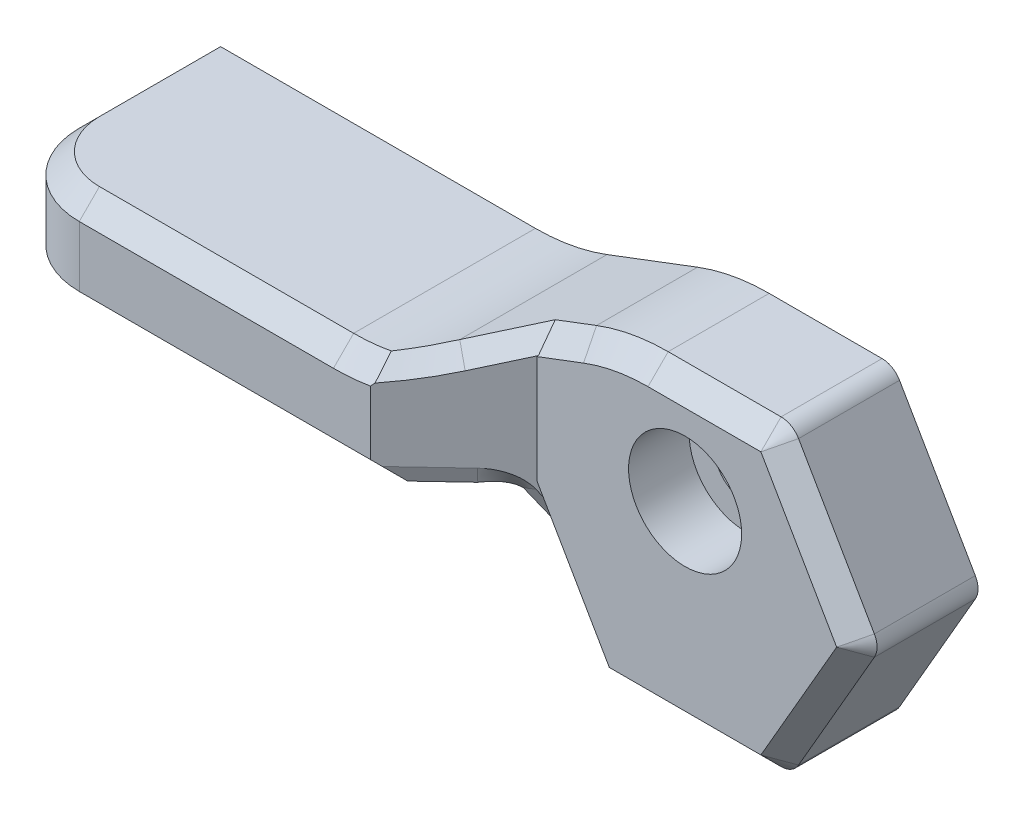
ISO-10303-21;
HEADER;
FILE_DESCRIPTION(('STEP AP214'),'2;1');
FILE_NAME('part.step','',(''),(''),'','','');
FILE_SCHEMA(('AUTOMOTIVE_DESIGN { 1 0 10303 214 1 1 1 1 }'));
ENDSEC;
DATA;
#1=APPLICATION_CONTEXT('core data for automotive mechanical design processes');
#2=APPLICATION_PROTOCOL_DEFINITION('international standard','automotive_design',2000,#1);
#3=PRODUCT_CONTEXT('',#1,'mechanical');
#4=PRODUCT('Part','Part','',(#3));
#5=PRODUCT_RELATED_PRODUCT_CATEGORY('part','',(#4));
#6=PRODUCT_DEFINITION_FORMATION('','',#4);
#7=PRODUCT_DEFINITION_CONTEXT('part definition',#1,'design');
#8=PRODUCT_DEFINITION('design','',#6,#7);
#9=PRODUCT_DEFINITION_SHAPE('','',#8);
#10=(LENGTH_UNIT() NAMED_UNIT(*) SI_UNIT(.MILLI.,.METRE.));
#11=(NAMED_UNIT(*) PLANE_ANGLE_UNIT() SI_UNIT($,.RADIAN.));
#12=(NAMED_UNIT(*) SI_UNIT($,.STERADIAN.) SOLID_ANGLE_UNIT());
#13=UNCERTAINTY_MEASURE_WITH_UNIT(LENGTH_MEASURE(1.E-05),#10,'distance_accuracy_value','');
#14=(GEOMETRIC_REPRESENTATION_CONTEXT(3) GLOBAL_UNCERTAINTY_ASSIGNED_CONTEXT((#13)) GLOBAL_UNIT_ASSIGNED_CONTEXT((#10,
#11,#12)) REPRESENTATION_CONTEXT('',''));
#15=CARTESIAN_POINT('',(0.,0.,0.));
#16=DIRECTION('',(0.,0.,1.));
#17=DIRECTION('',(1.,0.,0.));
#18=AXIS2_PLACEMENT_3D('',#15,#16,#17);
#19=CARTESIAN_POINT('',(0.,2.5,0.));
#20=DIRECTION('',(0.,0.,1.));
#21=DIRECTION('',(1.,0.,0.));
#22=AXIS2_PLACEMENT_3D('',#19,#20,#21);
#23=CYLINDRICAL_SURFACE('',#22,1.55);
#24=CARTESIAN_POINT('',(0.,2.5,0.));
#25=DIRECTION('',(0.,0.,1.));
#26=DIRECTION('',(1.,0.,0.));
#27=AXIS2_PLACEMENT_3D('',#24,#25,#26);
#28=CIRCLE('',#27,1.55);
#29=CARTESIAN_POINT('',(1.55,2.5,0.));
#30=VERTEX_POINT('',#29);
#31=EDGE_CURVE('E720',#30,#30,#28,.T.);
#32=ORIENTED_EDGE('',*,*,#31,.F.);
#33=EDGE_LOOP('',(#32));
#34=FACE_BOUND('',#33,.T.);
#35=CARTESIAN_POINT('',(0.,2.5,3.));
#36=DIRECTION('',(0.,0.,1.));
#37=DIRECTION('',(1.,0.,0.));
#38=AXIS2_PLACEMENT_3D('',#35,#36,#37);
#39=CIRCLE('',#38,1.55);
#40=CARTESIAN_POINT('',(1.55,2.5,3.));
#41=VERTEX_POINT('',#40);
#42=EDGE_CURVE('E725',#41,#41,#39,.F.);
#43=ORIENTED_EDGE('',*,*,#42,.F.);
#44=EDGE_LOOP('',(#43));
#45=FACE_BOUND('',#44,.T.);
#46=ADVANCED_FACE('F33',(#34,#45),#23,.F.);
#47=CARTESIAN_POINT('',(-11.5799906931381,4.5,10.));
#48=DIRECTION('',(0.35461398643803,-0.935012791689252,0.));
#49=DIRECTION('',(0.935012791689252,0.35461398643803,0.));
#50=AXIS2_PLACEMENT_3D('',#47,#48,#49);
#51=PLANE('',#50);
#52=DIRECTION('',(0.,0.,-1.));
#53=VECTOR('',#52,1.);
#54=CARTESIAN_POINT('',(-9.86646913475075,5.14987208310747,10.));
#55=LINE('',#54,#53);
#56=CARTESIAN_POINT('',(-9.86646913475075,5.14987208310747,0.));
#57=VERTEX_POINT('',#56);
#58=CARTESIAN_POINT('',(-9.86646913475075,5.14987208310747,7.29076062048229));
#59=VERTEX_POINT('',#58);
#60=EDGE_CURVE('E672',#57,#59,#55,.F.);
#61=ORIENTED_EDGE('',*,*,#60,.T.);
#62=DIRECTION('',(0.702167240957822,0.266304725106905,-0.660335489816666));
#63=VECTOR('',#62,1.);
#64=CARTESIAN_POINT('',(-12.0890037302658,4.30695115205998,9.38088728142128));
#65=LINE('',#64,#63);
#66=CARTESIAN_POINT('',(-7.43059057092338,6.07370608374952,5.00000000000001));
#67=VERTEX_POINT('',#66);
#68=EDGE_CURVE('E408',#59,#67,#65,.T.);
#69=ORIENTED_EDGE('',*,*,#68,.T.);
#70=DIRECTION('',(0.935012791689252,0.35461398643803,0.));
#71=VECTOR('',#70,1.);
#72=CARTESIAN_POINT('',(-11.5799906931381,4.5,5.00000000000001));
#73=LINE('',#72,#71);
#74=CARTESIAN_POINT('',(-5.38339453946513,6.85012791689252,5.00000000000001));
#75=VERTEX_POINT('',#74);
#76=EDGE_CURVE('E407',#67,#75,#73,.T.);
#77=ORIENTED_EDGE('',*,*,#76,.T.);
#78=DIRECTION('',(0.,0.,-1.));
#79=VECTOR('',#78,1.);
#80=CARTESIAN_POINT('',(-5.38339453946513,6.85012791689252,10.));
#81=LINE('',#80,#79);
#82=CARTESIAN_POINT('',(-5.38339453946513,6.85012791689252,0.));
#83=VERTEX_POINT('',#82);
#84=EDGE_CURVE('E676',#75,#83,#81,.T.);
#85=ORIENTED_EDGE('',*,*,#84,.T.);
#86=DIRECTION('',(-0.935012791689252,-0.35461398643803,0.));
#87=VECTOR('',#86,1.);
#88=CARTESIAN_POINT('',(-11.5799906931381,4.5,0.));
#89=LINE('',#88,#87);
#90=EDGE_CURVE('E711',#83,#57,#89,.T.);
#91=ORIENTED_EDGE('',*,*,#90,.T.);
#92=EDGE_LOOP('',(#61,#69,#77,#85,#91));
#93=FACE_BOUND('',#92,.T.);
#94=ADVANCED_FACE('F310',(#93),#51,.F.);
#95=CARTESIAN_POINT('',(-30.,4.5,10.));
#96=DIRECTION('',(0.,-1.,0.));
#97=DIRECTION('',(0.,0.,-1.));
#98=AXIS2_PLACEMENT_3D('',#95,#96,#97);
#99=PLANE('',#98);
#100=DIRECTION('',(-1.,0.,0.));
#101=VECTOR('',#100,1.);
#102=CARTESIAN_POINT('',(-30.,4.5,0.));
#103=LINE('',#102,#101);
#104=CARTESIAN_POINT('',(-13.4126089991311,4.5,0.));
#105=VERTEX_POINT('',#104);
#106=CARTESIAN_POINT('',(-29.,4.5,0.));
#107=VERTEX_POINT('',#106);
#108=EDGE_CURVE('E710',#105,#107,#103,.T.);
#109=ORIENTED_EDGE('',*,*,#108,.T.);
#110=DIRECTION('',(0.,0.,1.));
#111=VECTOR('',#110,1.);
#112=CARTESIAN_POINT('',(-29.,4.5,10.));
#113=LINE('',#112,#111);
#114=CARTESIAN_POINT('',(-29.,4.5,6.));
#115=VERTEX_POINT('',#114);
#116=EDGE_CURVE('E662',#107,#115,#113,.T.);
#117=ORIENTED_EDGE('',*,*,#116,.T.);
#118=CARTESIAN_POINT('',(-26.,4.5,6.));
#119=DIRECTION('',(0.,-1.,0.));
#120=DIRECTION('',(0.,0.,-1.));
#121=AXIS2_PLACEMENT_3D('',#118,#119,#120);
#122=CIRCLE('',#121,2.99999999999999);
#123=CARTESIAN_POINT('',(-26.,4.5,9.));
#124=VERTEX_POINT('',#123);
#125=EDGE_CURVE('E660',#115,#124,#122,.F.);
#126=ORIENTED_EDGE('',*,*,#125,.T.);
#127=DIRECTION('',(1.,0.,0.));
#128=VECTOR('',#127,1.);
#129=CARTESIAN_POINT('',(-13.4126089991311,4.5,9.));
#130=LINE('',#129,#128);
#131=CARTESIAN_POINT('',(-13.4126089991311,4.5,9.));
#132=VERTEX_POINT('',#131);
#133=EDGE_CURVE('E653',#124,#132,#130,.T.);
#134=ORIENTED_EDGE('',*,*,#133,.T.);
#135=DIRECTION('',(0.,0.,-1.));
#136=VECTOR('',#135,1.);
#137=CARTESIAN_POINT('',(-13.4126089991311,4.5,0.));
#138=LINE('',#137,#136);
#139=EDGE_CURVE('E739',#132,#105,#138,.T.);
#140=ORIENTED_EDGE('',*,*,#139,.T.);
#141=EDGE_LOOP('',(#109,#117,#126,#134,#140));
#142=FACE_BOUND('',#141,.T.);
#143=ADVANCED_FACE('F868',(#142),#99,.F.);
#144=CARTESIAN_POINT('',(-30.,4.5,10.));
#145=DIRECTION('',(1.,0.,0.));
#146=DIRECTION('',(0.,0.,-1.));
#147=AXIS2_PLACEMENT_3D('',#144,#145,#146);
#148=PLANE('',#147);
#149=DIRECTION('',(0.,-1.,0.));
#150=VECTOR('',#149,1.);
#151=CARTESIAN_POINT('',(-30.,4.5,6.));
#152=LINE('',#151,#150);
#153=CARTESIAN_POINT('',(-30.,0.500000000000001,6.));
#154=VERTEX_POINT('',#153);
#155=CARTESIAN_POINT('',(-30.,3.49999999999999,6.));
#156=VERTEX_POINT('',#155);
#157=EDGE_CURVE('E690',#154,#156,#152,.F.);
#158=ORIENTED_EDGE('',*,*,#157,.T.);
#159=DIRECTION('',(0.,0.,-1.));
#160=VECTOR('',#159,1.);
#161=CARTESIAN_POINT('',(-30.,3.49999999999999,10.));
#162=LINE('',#161,#160);
#163=CARTESIAN_POINT('',(-30.,3.49999999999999,0.));
#164=VERTEX_POINT('',#163);
#165=EDGE_CURVE('E651',#156,#164,#162,.T.);
#166=ORIENTED_EDGE('',*,*,#165,.T.);
#167=DIRECTION('',(0.,-1.,0.));
#168=VECTOR('',#167,1.);
#169=CARTESIAN_POINT('',(-30.,4.5,0.));
#170=LINE('',#169,#168);
#171=CARTESIAN_POINT('',(-30.,0.500000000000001,0.));
#172=VERTEX_POINT('',#171);
#173=EDGE_CURVE('E274',#164,#172,#170,.T.);
#174=ORIENTED_EDGE('',*,*,#173,.T.);
#175=DIRECTION('',(0.,0.,1.));
#176=VECTOR('',#175,1.);
#177=CARTESIAN_POINT('',(-30.,0.500000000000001,10.));
#178=LINE('',#177,#176);
#179=EDGE_CURVE('E647',#172,#154,#178,.T.);
#180=ORIENTED_EDGE('',*,*,#179,.T.);
#181=EDGE_LOOP('',(#158,#166,#174,#180));
#182=FACE_BOUND('',#181,.T.);
#183=ADVANCED_FACE('F694',(#182),#148,.F.);
#184=CARTESIAN_POINT('',(-30.,-0.500000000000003,10.));
#185=DIRECTION('',(0.,1.,0.));
#186=DIRECTION('',(0.,0.,1.));
#187=AXIS2_PLACEMENT_3D('',#184,#185,#186);
#188=PLANE('',#187);
#189=CARTESIAN_POINT('',(-26.,-0.500000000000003,6.));
#190=DIRECTION('',(0.,1.,0.));
#191=DIRECTION('',(0.,0.,1.));
#192=AXIS2_PLACEMENT_3D('',#189,#190,#191);
#193=CIRCLE('',#192,2.99999999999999);
#194=CARTESIAN_POINT('',(-26.,-0.500000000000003,8.99999999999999));
#195=VERTEX_POINT('',#194);
#196=CARTESIAN_POINT('',(-29.,-0.500000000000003,6.));
#197=VERTEX_POINT('',#196);
#198=EDGE_CURVE('E402',#195,#197,#193,.F.);
#199=ORIENTED_EDGE('',*,*,#198,.T.);
#200=DIRECTION('',(0.,0.,-1.));
#201=VECTOR('',#200,1.);
#202=CARTESIAN_POINT('',(-29.,-0.500000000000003,10.));
#203=LINE('',#202,#201);
#204=CARTESIAN_POINT('',(-29.,-0.500000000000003,0.));
#205=VERTEX_POINT('',#204);
#206=EDGE_CURVE('E290',#197,#205,#203,.T.);
#207=ORIENTED_EDGE('',*,*,#206,.T.);
#208=DIRECTION('',(1.,0.,0.));
#209=VECTOR('',#208,1.);
#210=CARTESIAN_POINT('',(-30.,-0.500000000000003,0.));
#211=LINE('',#210,#209);
#212=CARTESIAN_POINT('',(-8.9489291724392,-0.500000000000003,0.));
#213=VERTEX_POINT('',#212);
#214=EDGE_CURVE('E269',#205,#213,#211,.T.);
#215=ORIENTED_EDGE('',*,*,#214,.T.);
#216=DIRECTION('',(0.,0.,-1.));
#217=VECTOR('',#216,1.);
#218=CARTESIAN_POINT('',(-8.9489291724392,-0.500000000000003,10.));
#219=LINE('',#218,#217);
#220=CARTESIAN_POINT('',(-8.9489291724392,-0.500000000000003,7.31785616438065));
#221=VERTEX_POINT('',#220);
#222=EDGE_CURVE('E251',#213,#221,#219,.F.);
#223=ORIENTED_EDGE('',*,*,#222,.T.);
#224=DIRECTION('',(-0.72847321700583,0.,0.685074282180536));
#225=VECTOR('',#224,1.);
#226=CARTESIAN_POINT('',(-21.4587149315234,-0.500000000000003,19.0823689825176));
#227=LINE('',#226,#225);
#228=CARTESIAN_POINT('',(-10.7376355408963,-0.500000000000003,8.99999999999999));
#229=VERTEX_POINT('',#228);
#230=EDGE_CURVE('E396',#221,#229,#227,.T.);
#231=ORIENTED_EDGE('',*,*,#230,.T.);
#232=DIRECTION('',(-1.,0.,0.));
#233=VECTOR('',#232,1.);
#234=CARTESIAN_POINT('',(-26.,-0.500000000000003,8.99999999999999));
#235=LINE('',#234,#233);
#236=EDGE_CURVE('E399',#229,#195,#235,.T.);
#237=ORIENTED_EDGE('',*,*,#236,.T.);
#238=EDGE_LOOP('',(#199,#207,#215,#223,#231,#237));
#239=FACE_BOUND('',#238,.T.);
#240=ADVANCED_FACE('F638',(#239),#188,.F.);
#241=CARTESIAN_POINT('',(-8.37157890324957,-0.500000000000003,10.));
#242=DIRECTION('',(0.866025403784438,0.5,0.));
#243=DIRECTION('',(-0.5,0.866025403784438,0.));
#244=AXIS2_PLACEMENT_3D('',#241,#242,#243);
#245=PLANE('',#244);
#246=DIRECTION('',(-0.5,0.866025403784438,0.));
#247=VECTOR('',#246,1.);
#248=CARTESIAN_POINT('',(-8.37157890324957,-0.500000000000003,5.00000000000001));
#249=LINE('',#248,#247);
#250=CARTESIAN_POINT('',(-4.618802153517,-7.,5.00000000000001));
#251=VERTEX_POINT('',#250);
#252=CARTESIAN_POINT('',(-7.10358940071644,-2.69622224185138,5.00000000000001));
#253=VERTEX_POINT('',#252);
#254=EDGE_CURVE('E298',#251,#253,#249,.T.);
#255=ORIENTED_EDGE('',*,*,#254,.T.);
#256=DIRECTION('',(-0.452474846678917,0.783709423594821,0.42551856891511));
#257=VECTOR('',#256,1.);
#258=CARTESIAN_POINT('',(-9.10467129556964,0.769753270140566,6.8818670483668));
#259=LINE('',#258,#257);
#260=CARTESIAN_POINT('',(-8.08290376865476,-1.,5.92097152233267));
#261=VERTEX_POINT('',#260);
#262=EDGE_CURVE('E248',#253,#261,#259,.T.);
#263=ORIENTED_EDGE('',*,*,#262,.T.);
#264=DIRECTION('',(0.,0.,-1.));
#265=VECTOR('',#264,1.);
#266=CARTESIAN_POINT('',(-8.08290376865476,-1.,0.));
#267=LINE('',#266,#265);
#268=CARTESIAN_POINT('',(-8.08290376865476,-1.,0.));
#269=VERTEX_POINT('',#268);
#270=EDGE_CURVE('E240',#261,#269,#267,.T.);
#271=ORIENTED_EDGE('',*,*,#270,.T.);
#272=DIRECTION('',(0.5,-0.866025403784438,0.));
#273=VECTOR('',#272,1.);
#274=CARTESIAN_POINT('',(-8.37157890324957,-0.500000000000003,0.));
#275=LINE('',#274,#273);
#276=CARTESIAN_POINT('',(-4.618802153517,-7.,0.));
#277=VERTEX_POINT('',#276);
#278=EDGE_CURVE('E245',#269,#277,#275,.T.);
#279=ORIENTED_EDGE('',*,*,#278,.T.);
#280=DIRECTION('',(0.,0.,-1.));
#281=VECTOR('',#280,1.);
#282=CARTESIAN_POINT('',(-4.618802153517,-7.,10.));
#283=LINE('',#282,#281);
#284=EDGE_CURVE('E759',#277,#251,#283,.F.);
#285=ORIENTED_EDGE('',*,*,#284,.T.);
#286=EDGE_LOOP('',(#255,#263,#271,#279,#285));
#287=FACE_BOUND('',#286,.T.);
#288=ADVANCED_FACE('F242',(#287),#245,.F.);
#289=CARTESIAN_POINT('',(-4.33012701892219,-7.5,10.));
#290=DIRECTION('',(0.,1.,0.));
#291=DIRECTION('',(-1.,0.,0.));
#292=AXIS2_PLACEMENT_3D('',#289,#290,#291);
#293=PLANE('',#292);
#294=DIRECTION('',(0.,0.,-1.));
#295=VECTOR('',#294,1.);
#296=CARTESIAN_POINT('',(3.75277674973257,-7.5,10.));
#297=LINE('',#296,#295);
#298=CARTESIAN_POINT('',(3.75277674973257,-7.5,0.));
#299=VERTEX_POINT('',#298);
#300=CARTESIAN_POINT('',(3.75277674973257,-7.5,5.00000000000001));
#301=VERTEX_POINT('',#300);
#302=EDGE_CURVE('E261',#299,#301,#297,.F.);
#303=ORIENTED_EDGE('',*,*,#302,.T.);
#304=DIRECTION('',(-1.,0.,0.));
#305=VECTOR('',#304,1.);
#306=CARTESIAN_POINT('',(-4.33012701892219,-7.5,5.00000000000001));
#307=LINE('',#306,#305);
#308=CARTESIAN_POINT('',(-3.75277674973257,-7.5,5.00000000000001));
#309=VERTEX_POINT('',#308);
#310=EDGE_CURVE('E432',#301,#309,#307,.T.);
#311=ORIENTED_EDGE('',*,*,#310,.T.);
#312=DIRECTION('',(0.,0.,-1.));
#313=VECTOR('',#312,1.);
#314=CARTESIAN_POINT('',(-3.75277674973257,-7.5,10.));
#315=LINE('',#314,#313);
#316=CARTESIAN_POINT('',(-3.75277674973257,-7.5,0.));
#317=VERTEX_POINT('',#316);
#318=EDGE_CURVE('E768',#309,#317,#315,.T.);
#319=ORIENTED_EDGE('',*,*,#318,.T.);
#320=DIRECTION('',(1.,0.,0.));
#321=VECTOR('',#320,1.);
#322=CARTESIAN_POINT('',(-4.33012701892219,-7.5,0.));
#323=LINE('',#322,#321);
#324=EDGE_CURVE('E268',#317,#299,#323,.T.);
#325=ORIENTED_EDGE('',*,*,#324,.T.);
#326=EDGE_LOOP('',(#303,#311,#319,#325));
#327=FACE_BOUND('',#326,.T.);
#328=ADVANCED_FACE('F774',(#327),#293,.F.);
#329=CARTESIAN_POINT('',(4.33012701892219,-7.5,10.));
#330=DIRECTION('',(-0.866025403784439,0.5,0.));
#331=DIRECTION('',(-0.5,-0.866025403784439,0.));
#332=AXIS2_PLACEMENT_3D('',#329,#330,#331);
#333=PLANE('',#332);
#334=DIRECTION('',(0.,0.,-1.));
#335=VECTOR('',#334,1.);
#336=CARTESIAN_POINT('',(8.37157890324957,-0.499999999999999,10.));
#337=LINE('',#336,#335);
#338=CARTESIAN_POINT('',(8.37157890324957,-0.499999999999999,0.));
#339=VERTEX_POINT('',#338);
#340=CARTESIAN_POINT('',(8.37157890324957,-0.499999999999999,5.00000000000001));
#341=VERTEX_POINT('',#340);
#342=EDGE_CURVE('E756',#339,#341,#337,.F.);
#343=ORIENTED_EDGE('',*,*,#342,.T.);
#344=DIRECTION('',(-0.5,-0.866025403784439,0.));
#345=VECTOR('',#344,1.);
#346=CARTESIAN_POINT('',(4.33012701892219,-7.5,5.00000000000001));
#347=LINE('',#346,#345);
#348=CARTESIAN_POINT('',(4.61880215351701,-7.,5.00000000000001));
#349=VERTEX_POINT('',#348);
#350=EDGE_CURVE('E436',#341,#349,#347,.T.);
#351=ORIENTED_EDGE('',*,*,#350,.T.);
#352=DIRECTION('',(0.,0.,-1.));
#353=VECTOR('',#352,1.);
#354=CARTESIAN_POINT('',(4.61880215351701,-7.,10.));
#355=LINE('',#354,#353);
#356=CARTESIAN_POINT('',(4.61880215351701,-7.,0.));
#357=VERTEX_POINT('',#356);
#358=EDGE_CURVE('E752',#349,#357,#355,.T.);
#359=ORIENTED_EDGE('',*,*,#358,.T.);
#360=DIRECTION('',(0.5,0.866025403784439,0.));
#361=VECTOR('',#360,1.);
#362=CARTESIAN_POINT('',(4.33012701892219,-7.5,0.));
#363=LINE('',#362,#361);
#364=EDGE_CURVE('E272',#357,#339,#363,.T.);
#365=ORIENTED_EDGE('',*,*,#364,.T.);
#366=EDGE_LOOP('',(#343,#351,#359,#365));
#367=FACE_BOUND('',#366,.T.);
#368=ADVANCED_FACE('F806',(#367),#333,.F.);
#369=CARTESIAN_POINT('',(8.66025403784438,0.,10.));
#370=DIRECTION('',(-0.866025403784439,-0.5,0.));
#371=DIRECTION('',(0.5,-0.866025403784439,0.));
#372=AXIS2_PLACEMENT_3D('',#369,#370,#371);
#373=PLANE('',#372);
#374=DIRECTION('',(0.,0.,-1.));
#375=VECTOR('',#374,1.);
#376=CARTESIAN_POINT('',(4.618802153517,7.,10.));
#377=LINE('',#376,#375);
#378=CARTESIAN_POINT('',(4.618802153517,7.,0.));
#379=VERTEX_POINT('',#378);
#380=CARTESIAN_POINT('',(4.618802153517,7.,5.00000000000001));
#381=VERTEX_POINT('',#380);
#382=EDGE_CURVE('E747',#379,#381,#377,.F.);
#383=ORIENTED_EDGE('',*,*,#382,.T.);
#384=DIRECTION('',(0.5,-0.866025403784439,0.));
#385=VECTOR('',#384,1.);
#386=CARTESIAN_POINT('',(8.66025403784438,0.,5.00000000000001));
#387=LINE('',#386,#385);
#388=CARTESIAN_POINT('',(8.37157890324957,0.500000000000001,5.00000000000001));
#389=VERTEX_POINT('',#388);
#390=EDGE_CURVE('E440',#381,#389,#387,.T.);
#391=ORIENTED_EDGE('',*,*,#390,.T.);
#392=DIRECTION('',(0.,0.,-1.));
#393=VECTOR('',#392,1.);
#394=CARTESIAN_POINT('',(8.37157890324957,0.500000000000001,10.));
#395=LINE('',#394,#393);
#396=CARTESIAN_POINT('',(8.37157890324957,0.500000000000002,0.));
#397=VERTEX_POINT('',#396);
#398=EDGE_CURVE('E743',#389,#397,#395,.T.);
#399=ORIENTED_EDGE('',*,*,#398,.T.);
#400=DIRECTION('',(-0.5,0.866025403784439,0.));
#401=VECTOR('',#400,1.);
#402=CARTESIAN_POINT('',(8.66025403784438,0.,0.));
#403=LINE('',#402,#401);
#404=EDGE_CURVE('E280',#397,#379,#403,.T.);
#405=ORIENTED_EDGE('',*,*,#404,.T.);
#406=EDGE_LOOP('',(#383,#391,#399,#405));
#407=FACE_BOUND('',#406,.T.);
#408=ADVANCED_FACE('F880',(#407),#373,.F.);
#409=CARTESIAN_POINT('',(4.33012701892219,7.5,10.));
#410=DIRECTION('',(0.,-1.,0.));
#411=DIRECTION('',(1.,0.,0.));
#412=AXIS2_PLACEMENT_3D('',#409,#410,#411);
#413=PLANE('',#412);
#414=DIRECTION('',(0.,0.,-1.));
#415=VECTOR('',#414,1.);
#416=CARTESIAN_POINT('',(-1.83725467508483,7.5,10.));
#417=LINE('',#416,#415);
#418=CARTESIAN_POINT('',(-1.83725467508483,7.5,0.));
#419=VERTEX_POINT('',#418);
#420=CARTESIAN_POINT('',(-1.83725467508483,7.5,5.00000000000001));
#421=VERTEX_POINT('',#420);
#422=EDGE_CURVE('E682',#419,#421,#417,.F.);
#423=ORIENTED_EDGE('',*,*,#422,.T.);
#424=DIRECTION('',(1.,0.,0.));
#425=VECTOR('',#424,1.);
#426=CARTESIAN_POINT('',(4.33012701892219,7.5,5.00000000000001));
#427=LINE('',#426,#425);
#428=CARTESIAN_POINT('',(3.75277674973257,7.5,5.00000000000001));
#429=VERTEX_POINT('',#428);
#430=EDGE_CURVE('E444',#421,#429,#427,.T.);
#431=ORIENTED_EDGE('',*,*,#430,.T.);
#432=DIRECTION('',(0.,0.,-1.));
#433=VECTOR('',#432,1.);
#434=CARTESIAN_POINT('',(3.75277674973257,7.5,10.));
#435=LINE('',#434,#433);
#436=CARTESIAN_POINT('',(3.75277674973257,7.5,0.));
#437=VERTEX_POINT('',#436);
#438=EDGE_CURVE('E737',#429,#437,#435,.T.);
#439=ORIENTED_EDGE('',*,*,#438,.T.);
#440=DIRECTION('',(-1.,0.,0.));
#441=VECTOR('',#440,1.);
#442=CARTESIAN_POINT('',(4.33012701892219,7.5,0.));
#443=LINE('',#442,#441);
#444=EDGE_CURVE('E252',#437,#419,#443,.T.);
#445=ORIENTED_EDGE('',*,*,#444,.T.);
#446=EDGE_LOOP('',(#423,#431,#439,#445));
#447=FACE_BOUND('',#446,.T.);
#448=ADVANCED_FACE('F877',(#447),#413,.F.);
#449=CARTESIAN_POINT('',(0.,0.,10.));
#450=DIRECTION('',(0.,0.,1.));
#451=DIRECTION('',(1.,0.,0.));
#452=AXIS2_PLACEMENT_3D('',#449,#450,#451);
#453=PLANE('',#452);
#454=CARTESIAN_POINT('',(-13.4126089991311,14.5,10.));
#455=DIRECTION('',(0.,0.,1.));
#456=DIRECTION('',(1.,0.,0.));
#457=AXIS2_PLACEMENT_3D('',#454,#455,#456);
#458=CIRCLE('',#457,11.);
#459=CARTESIAN_POINT('',(-11.5799906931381,3.65373289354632,10.));
#460=VERTEX_POINT('',#459);
#461=CARTESIAN_POINT('',(-13.4126089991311,3.49999999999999,10.));
#462=VERTEX_POINT('',#461);
#463=EDGE_CURVE('E669',#460,#462,#458,.F.);
#464=ORIENTED_EDGE('',*,*,#463,.T.);
#465=DIRECTION('',(-1.,0.,0.));
#466=VECTOR('',#465,1.);
#467=CARTESIAN_POINT('',(-26.,3.49999999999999,10.));
#468=LINE('',#467,#466);
#469=CARTESIAN_POINT('',(-26.,3.49999999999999,10.));
#470=VERTEX_POINT('',#469);
#471=EDGE_CURVE('E671',#462,#470,#468,.T.);
#472=ORIENTED_EDGE('',*,*,#471,.T.);
#473=DIRECTION('',(0.,-1.,0.));
#474=VECTOR('',#473,1.);
#475=CARTESIAN_POINT('',(-26.,-0.500000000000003,10.));
#476=LINE('',#475,#474);
#477=CARTESIAN_POINT('',(-26.,0.500000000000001,10.));
#478=VERTEX_POINT('',#477);
#479=EDGE_CURVE('E687',#470,#478,#476,.T.);
#480=ORIENTED_EDGE('',*,*,#479,.T.);
#481=DIRECTION('',(1.,0.,0.));
#482=VECTOR('',#481,1.);
#483=CARTESIAN_POINT('',(-11.5799906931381,0.500000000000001,10.));
#484=LINE('',#483,#482);
#485=CARTESIAN_POINT('',(-11.5799906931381,0.499999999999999,10.));
#486=VERTEX_POINT('',#485);
#487=EDGE_CURVE('E667',#478,#486,#484,.T.);
#488=ORIENTED_EDGE('',*,*,#487,.T.);
#489=DIRECTION('',(0.,1.,0.));
#490=VECTOR('',#489,1.);
#491=CARTESIAN_POINT('',(-11.5799906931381,-7.5,10.));
#492=LINE('',#491,#490);
#493=EDGE_CURVE('E716',#486,#460,#492,.T.);
#494=ORIENTED_EDGE('',*,*,#493,.T.);
#495=EDGE_LOOP('',(#464,#472,#480,#488,#494));
#496=FACE_BOUND('',#495,.T.);
#497=ADVANCED_FACE('F863',(#496),#453,.T.);
#498=CARTESIAN_POINT('',(0.,0.,0.));
#499=DIRECTION('',(0.,0.,1.));
#500=DIRECTION('',(1.,0.,0.));
#501=AXIS2_PLACEMENT_3D('',#498,#499,#500);
#502=PLANE('',#501);
#503=ORIENTED_EDGE('',*,*,#31,.T.);
#504=EDGE_LOOP('',(#503));
#505=FACE_BOUND('',#504,.T.);
#506=ORIENTED_EDGE('',*,*,#173,.F.);
#507=DIRECTION('',(-0.707106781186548,-0.707106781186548,0.));
#508=VECTOR('',#507,1.);
#509=CARTESIAN_POINT('',(-30.,3.49999999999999,0.));
#510=LINE('',#509,#508);
#511=EDGE_CURVE('E650',#164,#107,#510,.F.);
#512=ORIENTED_EDGE('',*,*,#511,.T.);
#513=ORIENTED_EDGE('',*,*,#108,.F.);
#514=CARTESIAN_POINT('',(-13.4126089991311,14.5,0.));
#515=DIRECTION('',(0.,0.,1.));
#516=DIRECTION('',(1.,0.,0.));
#517=AXIS2_PLACEMENT_3D('',#514,#515,#516);
#518=CIRCLE('',#517,10.);
#519=EDGE_CURVE('E685',#105,#57,#518,.T.);
#520=ORIENTED_EDGE('',*,*,#519,.T.);
#521=ORIENTED_EDGE('',*,*,#90,.F.);
#522=CARTESIAN_POINT('',(-1.83725467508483,-2.5,0.));
#523=DIRECTION('',(0.,0.,1.));
#524=DIRECTION('',(1.,0.,0.));
#525=AXIS2_PLACEMENT_3D('',#522,#523,#524);
#526=CIRCLE('',#525,10.);
#527=EDGE_CURVE('E675',#83,#419,#526,.F.);
#528=ORIENTED_EDGE('',*,*,#527,.T.);
#529=ORIENTED_EDGE('',*,*,#444,.F.);
#530=CARTESIAN_POINT('',(3.75277674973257,6.5,0.));
#531=DIRECTION('',(0.,0.,1.));
#532=DIRECTION('',(1.,0.,0.));
#533=AXIS2_PLACEMENT_3D('',#530,#531,#532);
#534=CIRCLE('',#533,1.);
#535=EDGE_CURVE('E766',#437,#379,#534,.F.);
#536=ORIENTED_EDGE('',*,*,#535,.T.);
#537=ORIENTED_EDGE('',*,*,#404,.F.);
#538=CARTESIAN_POINT('',(7.50555349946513,0.,0.));
#539=DIRECTION('',(0.,0.,1.));
#540=DIRECTION('',(1.,0.,0.));
#541=AXIS2_PLACEMENT_3D('',#538,#539,#540);
#542=CIRCLE('',#541,1.);
#543=EDGE_CURVE('E764',#397,#339,#542,.F.);
#544=ORIENTED_EDGE('',*,*,#543,.T.);
#545=ORIENTED_EDGE('',*,*,#364,.F.);
#546=CARTESIAN_POINT('',(3.75277674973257,-6.5,0.));
#547=DIRECTION('',(0.,0.,1.));
#548=DIRECTION('',(1.,0.,0.));
#549=AXIS2_PLACEMENT_3D('',#546,#547,#548);
#550=CIRCLE('',#549,1.);
#551=EDGE_CURVE('E762',#357,#299,#550,.F.);
#552=ORIENTED_EDGE('',*,*,#551,.T.);
#553=ORIENTED_EDGE('',*,*,#324,.F.);
#554=CARTESIAN_POINT('',(-3.75277674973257,-6.5,0.));
#555=DIRECTION('',(0.,0.,1.));
#556=DIRECTION('',(1.,0.,0.));
#557=AXIS2_PLACEMENT_3D('',#554,#555,#556);
#558=CIRCLE('',#557,1.);
#559=EDGE_CURVE('E267',#317,#277,#558,.F.);
#560=ORIENTED_EDGE('',*,*,#559,.T.);
#561=ORIENTED_EDGE('',*,*,#278,.F.);
#562=CARTESIAN_POINT('',(-8.9489291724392,-1.5,0.));
#563=DIRECTION('',(0.,0.,1.));
#564=DIRECTION('',(1.,0.,0.));
#565=AXIS2_PLACEMENT_3D('',#562,#563,#564);
#566=CIRCLE('',#565,1.);
#567=EDGE_CURVE('E256',#269,#213,#566,.T.);
#568=ORIENTED_EDGE('',*,*,#567,.T.);
#569=ORIENTED_EDGE('',*,*,#214,.F.);
#570=DIRECTION('',(0.707106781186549,-0.707106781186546,0.));
#571=VECTOR('',#570,1.);
#572=CARTESIAN_POINT('',(-29.,-0.500000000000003,0.));
#573=LINE('',#572,#571);
#574=EDGE_CURVE('E648',#205,#172,#573,.F.);
#575=ORIENTED_EDGE('',*,*,#574,.T.);
#576=EDGE_LOOP('',(#506,#512,#513,#520,#521,#528,#529,#536,#537,#544,#545,#552,#553,#560,#561,
#568,#569,#575));
#577=FACE_BOUND('',#576,.T.);
#578=ADVANCED_FACE('F264',(#505,#577),#502,.F.);
#579=CARTESIAN_POINT('',(-8.9489291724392,-1.5,10.));
#580=DIRECTION('',(0.,0.,1.));
#581=DIRECTION('',(1.,0.,0.));
#582=AXIS2_PLACEMENT_3D('',#579,#580,#581);
#583=CYLINDRICAL_SURFACE('',#582,1.);
#584=ORIENTED_EDGE('',*,*,#270,.F.);
#585=CARTESIAN_POINT('',(-8.9489291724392,-0.500000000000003,7.31785616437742));
#586=CARTESIAN_POINT('',(-8.90529589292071,-0.499999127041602,7.24747640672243));
#587=CARTESIAN_POINT('',(-8.8616629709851,-0.502859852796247,7.17709722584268));
#588=CARTESIAN_POINT('',(-8.7751429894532,-0.514250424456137,7.03754192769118));
#589=CARTESIAN_POINT('',(-8.73225663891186,-0.522781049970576,6.96836695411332));
#590=CARTESIAN_POINT('',(-8.6479636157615,-0.545367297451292,6.83240370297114));
#591=CARTESIAN_POINT('',(-8.60655763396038,-0.559422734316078,6.76561653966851));
#592=CARTESIAN_POINT('',(-8.52593384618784,-0.592818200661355,6.63557170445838));
#593=CARTESIAN_POINT('',(-8.48671670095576,-0.612157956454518,6.57231509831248));
#594=CARTESIAN_POINT('',(-8.41114164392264,-0.65579123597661,6.45041378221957));
#595=CARTESIAN_POINT('',(-8.37478435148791,-0.680084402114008,6.39177007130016));
#596=CARTESIAN_POINT('',(-8.30555113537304,-0.733208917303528,6.28009803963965));
#597=CARTESIAN_POINT('',(-8.27267577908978,-0.762039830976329,6.22707063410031));
#598=CARTESIAN_POINT('',(-8.21096900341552,-0.823746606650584,6.12753862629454));
#599=CARTESIAN_POINT('',(-8.18213808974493,-0.856621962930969,6.08103483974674));
#600=CARTESIAN_POINT('',(-8.12901357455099,-0.925855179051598,5.99534587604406));
#601=CARTESIAN_POINT('',(-8.10471965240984,-0.962212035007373,5.95616018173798));
#602=CARTESIAN_POINT('',(-8.08290376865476,-1.,5.92097152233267));
#603=B_SPLINE_CURVE_WITH_KNOTS('',3,(#585,#586,#587,#588,#589,#590,#591,#592,#593,#594,#595,
#596,#597,#598,#599,#600,#601,#602),.UNSPECIFIED.,.F.,.F.,(4,2,2,2,2,2,2,2,4),(1.5707963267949,
1.70169602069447,1.83259571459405,1.96349540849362,2.09439510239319,2.22529479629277,
2.35619449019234,2.48709418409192,2.61799387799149),.UNSPECIFIED.);
#604=EDGE_CURVE('E293',#261,#221,#603,.F.);
#605=ORIENTED_EDGE('',*,*,#604,.T.);
#606=ORIENTED_EDGE('',*,*,#222,.F.);
#607=ORIENTED_EDGE('',*,*,#567,.F.);
#608=EDGE_LOOP('',(#584,#605,#606,#607));
#609=FACE_BOUND('',#608,.T.);
#610=ADVANCED_FACE('F257',(#609),#583,.F.);
#611=CARTESIAN_POINT('',(-3.75277674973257,-6.5,10.));
#612=DIRECTION('',(0.,0.,-1.));
#613=DIRECTION('',(-1.,0.,0.));
#614=AXIS2_PLACEMENT_3D('',#611,#612,#613);
#615=CYLINDRICAL_SURFACE('',#614,1.);
#616=ORIENTED_EDGE('',*,*,#318,.F.);
#617=CARTESIAN_POINT('',(-3.75277674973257,-6.5,5.00000000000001));
#618=DIRECTION('',(0.,0.,-1.));
#619=DIRECTION('',(-1.,0.,0.));
#620=AXIS2_PLACEMENT_3D('',#617,#618,#619);
#621=CIRCLE('',#620,1.);
#622=EDGE_CURVE('E430',#309,#251,#621,.T.);
#623=ORIENTED_EDGE('',*,*,#622,.T.);
#624=ORIENTED_EDGE('',*,*,#284,.F.);
#625=ORIENTED_EDGE('',*,*,#559,.F.);
#626=EDGE_LOOP('',(#616,#623,#624,#625));
#627=FACE_BOUND('',#626,.T.);
#628=ADVANCED_FACE('F309',(#627),#615,.T.);
#629=CARTESIAN_POINT('',(3.75277674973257,-6.5,10.));
#630=DIRECTION('',(0.,0.,-1.));
#631=DIRECTION('',(-1.,0.,0.));
#632=AXIS2_PLACEMENT_3D('',#629,#630,#631);
#633=CYLINDRICAL_SURFACE('',#632,1.);
#634=ORIENTED_EDGE('',*,*,#358,.F.);
#635=CARTESIAN_POINT('',(3.75277674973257,-6.5,5.00000000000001));
#636=DIRECTION('',(0.,0.,-1.));
#637=DIRECTION('',(-1.,0.,0.));
#638=AXIS2_PLACEMENT_3D('',#635,#636,#637);
#639=CIRCLE('',#638,1.);
#640=EDGE_CURVE('E434',#349,#301,#639,.T.);
#641=ORIENTED_EDGE('',*,*,#640,.T.);
#642=ORIENTED_EDGE('',*,*,#302,.F.);
#643=ORIENTED_EDGE('',*,*,#551,.F.);
#644=EDGE_LOOP('',(#634,#641,#642,#643));
#645=FACE_BOUND('',#644,.T.);
#646=ADVANCED_FACE('F314',(#645),#633,.T.);
#647=CARTESIAN_POINT('',(7.50555349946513,0.,10.));
#648=DIRECTION('',(0.,0.,-1.));
#649=DIRECTION('',(-1.,0.,0.));
#650=AXIS2_PLACEMENT_3D('',#647,#648,#649);
#651=CYLINDRICAL_SURFACE('',#650,1.);
#652=ORIENTED_EDGE('',*,*,#398,.F.);
#653=CARTESIAN_POINT('',(7.50555349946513,0.,5.00000000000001));
#654=DIRECTION('',(0.,0.,-1.));
#655=DIRECTION('',(-1.,0.,0.));
#656=AXIS2_PLACEMENT_3D('',#653,#654,#655);
#657=CIRCLE('',#656,1.);
#658=EDGE_CURVE('E438',#389,#341,#657,.T.);
#659=ORIENTED_EDGE('',*,*,#658,.T.);
#660=ORIENTED_EDGE('',*,*,#342,.F.);
#661=ORIENTED_EDGE('',*,*,#543,.F.);
#662=EDGE_LOOP('',(#652,#659,#660,#661));
#663=FACE_BOUND('',#662,.T.);
#664=ADVANCED_FACE('F318',(#663),#651,.T.);
#665=CARTESIAN_POINT('',(3.75277674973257,6.5,10.));
#666=DIRECTION('',(0.,0.,-1.));
#667=DIRECTION('',(-1.,0.,0.));
#668=AXIS2_PLACEMENT_3D('',#665,#666,#667);
#669=CYLINDRICAL_SURFACE('',#668,1.);
#670=ORIENTED_EDGE('',*,*,#438,.F.);
#671=CARTESIAN_POINT('',(3.75277674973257,6.5,5.00000000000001));
#672=DIRECTION('',(0.,0.,-1.));
#673=DIRECTION('',(-1.,0.,0.));
#674=AXIS2_PLACEMENT_3D('',#671,#672,#673);
#675=CIRCLE('',#674,1.);
#676=EDGE_CURVE('E442',#429,#381,#675,.T.);
#677=ORIENTED_EDGE('',*,*,#676,.T.);
#678=ORIENTED_EDGE('',*,*,#382,.F.);
#679=ORIENTED_EDGE('',*,*,#535,.F.);
#680=EDGE_LOOP('',(#670,#677,#678,#679));
#681=FACE_BOUND('',#680,.T.);
#682=ADVANCED_FACE('F322',(#681),#669,.T.);
#683=CARTESIAN_POINT('',(-11.5799906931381,-7.5,10.));
#684=DIRECTION('',(-0.685074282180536,0.,-0.72847321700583));
#685=DIRECTION('',(-0.72847321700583,0.,0.685074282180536));
#686=AXIS2_PLACEMENT_3D('',#683,#684,#685);
#687=PLANE('',#686);
#688=ORIENTED_EDGE('',*,*,#493,.F.);
#689=DIRECTION('',(0.600972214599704,-0.565169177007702,-0.565169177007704));
#690=VECTOR('',#689,1.);
#691=CARTESIAN_POINT('',(-7.39767321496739,-3.4331550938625,6.06684490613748));
#692=LINE('',#691,#690);
#693=CARTESIAN_POINT('',(-11.2771113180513,0.215164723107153,9.71516472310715));
#694=VERTEX_POINT('',#693);
#695=EDGE_CURVE('E392',#486,#694,#692,.T.);
#696=ORIENTED_EDGE('',*,*,#695,.T.);
#697=DIRECTION('',(0.72847321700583,0.,-0.685074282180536));
#698=VECTOR('',#697,1.);
#699=CARTESIAN_POINT('',(-11.5799906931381,0.215164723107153,10.));
#700=LINE('',#699,#698);
#701=CARTESIAN_POINT('',(-8.84521073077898,0.21516472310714,7.42814509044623));
#702=VERTEX_POINT('',#701);
#703=EDGE_CURVE('E390',#694,#702,#700,.T.);
#704=ORIENTED_EDGE('',*,*,#703,.T.);
#705=CARTESIAN_POINT('',(-7.35983450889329,-0.64241763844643,6.03126044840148));
#706=CARTESIAN_POINT('',(-7.39725234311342,-0.577605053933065,6.06644910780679));
#707=CARTESIAN_POINT('',(-7.43892042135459,-0.515247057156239,6.10563480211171));
#708=CARTESIAN_POINT('',(-7.53003771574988,-0.396500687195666,6.19132376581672));
#709=CARTESIAN_POINT('',(-7.57948748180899,-0.340114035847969,6.23782755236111));
#710=CARTESIAN_POINT('',(-7.68532476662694,-0.234276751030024,6.33735956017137));
#711=CARTESIAN_POINT('',(-7.7417114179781,-0.184826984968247,6.39038696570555));
#712=CARTESIAN_POINT('',(-7.86045778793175,-0.0937096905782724,6.50205899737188));
#713=CARTESIAN_POINT('',(-7.92281653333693,-0.0520429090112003,6.56070270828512));
#714=CARTESIAN_POINT('',(-8.05244020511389,0.0227953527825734,6.68260402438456));
#715=CARTESIAN_POINT('',(-8.11970406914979,0.055966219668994,6.74586063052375));
#716=CARTESIAN_POINT('',(-8.25798714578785,0.113244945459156,6.87590546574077));
#717=CARTESIAN_POINT('',(-8.32900522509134,0.137352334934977,6.94269262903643));
#718=CARTESIAN_POINT('',(-8.47358164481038,0.176091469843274,7.07865588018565));
#719=CARTESIAN_POINT('',(-8.54713880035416,0.190722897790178,7.14783085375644));
#720=CARTESIAN_POINT('',(-8.69553482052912,0.210259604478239,7.28738615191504));
#721=CARTESIAN_POINT('',(-8.7703724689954,0.215166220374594,7.35776533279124));
#722=CARTESIAN_POINT('',(-8.84521073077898,0.21516472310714,7.42814509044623));
#723=B_SPLINE_CURVE_WITH_KNOTS('',3,(#705,#706,#707,#708,#709,#710,#711,#712,#713,#714,#715,
#716,#717,#718,#719,#720,#721,#722),.UNSPECIFIED.,.F.,.F.,(4,2,2,2,2,2,2,2,4),(1.5707963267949,
1.70169602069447,1.83259571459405,1.96349540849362,2.09439510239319,2.22529479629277,
2.35619449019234,2.48709418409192,2.61799387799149),.UNSPECIFIED.);
#724=CARTESIAN_POINT('',(-7.35983450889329,-0.642417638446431,6.03126044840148));
#725=VERTEX_POINT('',#724);
#726=EDGE_CURVE('E386',#702,#725,#723,.F.);
#727=ORIENTED_EDGE('',*,*,#726,.T.);
#728=DIRECTION('',(0.452474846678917,-0.783709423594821,-0.42551856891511));
#729=VECTOR('',#728,1.);
#730=CARTESIAN_POINT('',(-6.55620975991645,-2.03433653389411,5.27551180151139));
#731=LINE('',#730,#729);
#732=CARTESIAN_POINT('',(-7.11922737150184,-1.05916142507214,5.80498752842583));
#733=VERTEX_POINT('',#732);
#734=EDGE_CURVE('E59',#725,#733,#731,.T.);
#735=ORIENTED_EDGE('',*,*,#734,.T.);
#736=DIRECTION('',(0.258738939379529,-0.934798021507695,-0.243324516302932));
#737=VECTOR('',#736,1.);
#738=CARTESIAN_POINT('',(-6.12412760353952,-4.65435778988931,4.86917102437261));
#739=LINE('',#738,#737);
#740=CARTESIAN_POINT('',(-7.32659373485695,-0.309967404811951,6.));
#741=VERTEX_POINT('',#740);
#742=EDGE_CURVE('E44',#733,#741,#739,.F.);
#743=ORIENTED_EDGE('',*,*,#742,.T.);
#744=DIRECTION('',(0.,1.,0.));
#745=VECTOR('',#744,1.);
#746=CARTESIAN_POINT('',(-7.32659373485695,-7.5,6.));
#747=LINE('',#746,#745);
#748=CARTESIAN_POINT('',(-7.32659373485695,5.0436439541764,6.));
#749=VERTEX_POINT('',#748);
#750=EDGE_CURVE('E717',#741,#749,#747,.T.);
#751=ORIENTED_EDGE('',*,*,#750,.T.);
#752=DIRECTION('',(-0.512802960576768,-0.71025736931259,0.482252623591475));
#753=VECTOR('',#752,1.);
#754=CARTESIAN_POINT('',(-14.0029706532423,-4.20346706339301,12.2786304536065));
#755=LINE('',#754,#753);
#756=CARTESIAN_POINT('',(-7.29473801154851,5.08776570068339,5.97004208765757));
#757=VERTEX_POINT('',#756);
#758=EDGE_CURVE('E12',#749,#757,#755,.F.);
#759=ORIENTED_EDGE('',*,*,#758,.T.);
#760=DIRECTION('',(-0.702167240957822,-0.266304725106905,0.660335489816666));
#761=VECTOR('',#760,1.);
#762=CARTESIAN_POINT('',(-13.6298802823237,2.68509263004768,11.9277670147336));
#763=LINE('',#762,#761);
#764=CARTESIAN_POINT('',(-9.16346023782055,4.37903204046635,7.72743482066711));
#765=VERTEX_POINT('',#764);
#766=EDGE_CURVE('E52',#757,#765,#763,.T.);
#767=ORIENTED_EDGE('',*,*,#766,.T.);
#768=CARTESIAN_POINT('',(-11.7038894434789,3.75369674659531,10.1165174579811));
#769=CARTESIAN_POINT('',(-10.8359496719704,3.8584251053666,9.3002853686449));
#770=CARTESIAN_POINT('',(-9.98084231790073,4.0689126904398,8.49612120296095));
#771=CARTESIAN_POINT('',(-9.16346023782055,4.37903204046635,7.72743482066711));
#772=B_SPLINE_CURVE_WITH_KNOTS('',3,(#768,#769,#770,#771),.UNSPECIFIED.,.F.,.F.,(4,4),
(4.34988778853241,4.59218002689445),.UNSPECIFIED.);
#773=CARTESIAN_POINT('',(-11.4634377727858,3.78546118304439,9.89039074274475));
#774=VERTEX_POINT('',#773);
#775=EDGE_CURVE('E354',#765,#774,#772,.F.);
#776=ORIENTED_EDGE('',*,*,#775,.T.);
#777=CARTESIAN_POINT('',(-116.918796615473,14.5,109.063225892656));
#778=DIRECTION('',(-0.685074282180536,0.,-0.72847321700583));
#779=DIRECTION('',(-0.72847321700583,0.,0.685074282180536));
#780=AXIS2_PLACEMENT_3D('',#777,#778,#779);
#781=ELLIPSE('',#780,151.087539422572,37.4216891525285);
#782=EDGE_CURVE('E387',#774,#460,#781,.T.);
#783=ORIENTED_EDGE('',*,*,#782,.T.);
#784=EDGE_LOOP('',(#688,#696,#704,#727,#735,#743,#751,#759,#767,#776,#783));
#785=FACE_BOUND('',#784,.T.);
#786=ADVANCED_FACE('F326',(#785),#687,.F.);
#787=CARTESIAN_POINT('',(-7.32659373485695,-7.5,6.));
#788=DIRECTION('',(0.,0.,-1.));
#789=DIRECTION('',(-1.,0.,0.));
#790=AXIS2_PLACEMENT_3D('',#787,#788,#789);
#791=PLANE('',#790);
#792=CARTESIAN_POINT('',(0.,2.5,6.));
#793=DIRECTION('',(0.,0.,1.));
#794=DIRECTION('',(1.,0.,0.));
#795=AXIS2_PLACEMENT_3D('',#792,#793,#794);
#796=CIRCLE('',#795,2.8);
#797=CARTESIAN_POINT('',(2.8,2.5,6.));
#798=VERTEX_POINT('',#797);
#799=EDGE_CURVE('E506',#798,#798,#796,.T.);
#800=ORIENTED_EDGE('',*,*,#799,.F.);
#801=EDGE_LOOP('',(#800));
#802=FACE_BOUND('',#801,.T.);
#803=ORIENTED_EDGE('',*,*,#750,.F.);
#804=DIRECTION('',(0.5,-0.866025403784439,0.));
#805=VECTOR('',#804,1.);
#806=CARTESIAN_POINT('',(-4.21321829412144,-5.70249185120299,6.));
#807=LINE('',#806,#805);
#808=CARTESIAN_POINT('',(-3.75277674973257,-6.5,6.));
#809=VERTEX_POINT('',#808);
#810=EDGE_CURVE('E428',#741,#809,#807,.T.);
#811=ORIENTED_EDGE('',*,*,#810,.T.);
#812=DIRECTION('',(1.,0.,0.));
#813=VECTOR('',#812,1.);
#814=CARTESIAN_POINT('',(-7.32659373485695,-6.5,6.));
#815=LINE('',#814,#813);
#816=CARTESIAN_POINT('',(3.75277674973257,-6.5,6.));
#817=VERTEX_POINT('',#816);
#818=EDGE_CURVE('E426',#809,#817,#815,.T.);
#819=ORIENTED_EDGE('',*,*,#818,.T.);
#820=DIRECTION('',(0.5,0.866025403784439,0.));
#821=VECTOR('',#820,1.);
#822=CARTESIAN_POINT('',(0.54992142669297,-12.047508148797,6.));
#823=LINE('',#822,#821);
#824=CARTESIAN_POINT('',(7.50555349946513,0.,6.));
#825=VERTEX_POINT('',#824);
#826=EDGE_CURVE('E424',#817,#825,#823,.T.);
#827=ORIENTED_EDGE('',*,*,#826,.T.);
#828=DIRECTION('',(-0.5,0.866025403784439,0.));
#829=VECTOR('',#828,1.);
#830=CARTESIAN_POINT('',(7.04511195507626,0.797508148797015,6.));
#831=LINE('',#830,#829);
#832=CARTESIAN_POINT('',(3.75277674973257,6.5,6.));
#833=VERTEX_POINT('',#832);
#834=EDGE_CURVE('E422',#825,#833,#831,.T.);
#835=ORIENTED_EDGE('',*,*,#834,.T.);
#836=DIRECTION('',(-1.,0.,0.));
#837=VECTOR('',#836,1.);
#838=CARTESIAN_POINT('',(-7.32659373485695,6.5,6.));
#839=LINE('',#838,#837);
#840=CARTESIAN_POINT('',(-1.83725467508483,6.5,6.));
#841=VERTEX_POINT('',#840);
#842=EDGE_CURVE('E420',#833,#841,#839,.T.);
#843=ORIENTED_EDGE('',*,*,#842,.T.);
#844=CARTESIAN_POINT('',(-1.83725467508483,-2.5,6.));
#845=DIRECTION('',(0.,0.,-1.));
#846=DIRECTION('',(-1.,0.,0.));
#847=AXIS2_PLACEMENT_3D('',#844,#845,#846);
#848=CIRCLE('',#847,9.);
#849=CARTESIAN_POINT('',(-5.0287805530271,5.91511512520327,6.));
#850=VERTEX_POINT('',#849);
#851=EDGE_CURVE('E418',#841,#850,#848,.F.);
#852=ORIENTED_EDGE('',*,*,#851,.T.);
#853=DIRECTION('',(-0.935012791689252,-0.35461398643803,0.));
#854=VECTOR('',#853,1.);
#855=CARTESIAN_POINT('',(-11.4856723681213,3.46626718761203,6.));
#856=LINE('',#855,#854);
#857=EDGE_CURVE('E414',#850,#749,#856,.T.);
#858=ORIENTED_EDGE('',*,*,#857,.T.);
#859=EDGE_LOOP('',(#803,#811,#819,#827,#835,#843,#852,#858));
#860=FACE_BOUND('',#859,.T.);
#861=ADVANCED_FACE('F370',(#802,#860),#791,.F.);
#862=CARTESIAN_POINT('',(0.,2.5,3.));
#863=DIRECTION('',(0.,0.,1.));
#864=DIRECTION('',(1.,0.,0.));
#865=AXIS2_PLACEMENT_3D('',#862,#863,#864);
#866=PLANE('',#865);
#867=CARTESIAN_POINT('',(0.,2.5,3.));
#868=DIRECTION('',(0.,0.,1.));
#869=DIRECTION('',(1.,0.,0.));
#870=AXIS2_PLACEMENT_3D('',#867,#868,#869);
#871=CIRCLE('',#870,2.8);
#872=CARTESIAN_POINT('',(2.8,2.5,3.));
#873=VERTEX_POINT('',#872);
#874=EDGE_CURVE('E728',#873,#873,#871,.T.);
#875=ORIENTED_EDGE('',*,*,#874,.T.);
#876=EDGE_LOOP('',(#875));
#877=FACE_BOUND('',#876,.T.);
#878=ORIENTED_EDGE('',*,*,#42,.T.);
#879=EDGE_LOOP('',(#878));
#880=FACE_BOUND('',#879,.T.);
#881=ADVANCED_FACE('F972',(#877,#880),#866,.T.);
#882=CARTESIAN_POINT('',(0.,2.5,3.));
#883=DIRECTION('',(0.,0.,1.));
#884=DIRECTION('',(1.,0.,0.));
#885=AXIS2_PLACEMENT_3D('',#882,#883,#884);
#886=CYLINDRICAL_SURFACE('',#885,2.8);
#887=ORIENTED_EDGE('',*,*,#874,.F.);
#888=EDGE_LOOP('',(#887));
#889=FACE_BOUND('',#888,.T.);
#890=ORIENTED_EDGE('',*,*,#799,.T.);
#891=EDGE_LOOP('',(#890));
#892=FACE_BOUND('',#891,.T.);
#893=ADVANCED_FACE('F333',(#889,#892),#886,.F.);
#894=CARTESIAN_POINT('',(-13.4126089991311,14.5,10.));
#895=DIRECTION('',(0.,0.,1.));
#896=DIRECTION('',(1.,0.,0.));
#897=AXIS2_PLACEMENT_3D('',#894,#895,#896);
#898=CYLINDRICAL_SURFACE('',#897,10.);
#899=ORIENTED_EDGE('',*,*,#139,.F.);
#900=CARTESIAN_POINT('',(-13.4126089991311,14.5,9.));
#901=DIRECTION('',(0.,0.,1.));
#902=DIRECTION('',(1.,0.,0.));
#903=AXIS2_PLACEMENT_3D('',#900,#901,#902);
#904=CIRCLE('',#903,10.);
#905=CARTESIAN_POINT('',(-11.5455608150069,4.67583942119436,8.99999963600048));
#906=VERTEX_POINT('',#905);
#907=EDGE_CURVE('E342',#132,#906,#904,.T.);
#908=ORIENTED_EDGE('',*,*,#907,.T.);
#909=CARTESIAN_POINT('',(-9.86646913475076,5.14987208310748,7.29076062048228));
#910=CARTESIAN_POINT('',(-10.6215972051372,4.86337225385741,8.05944700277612));
#911=CARTESIAN_POINT('',(-11.4115772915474,4.66891596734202,8.86361116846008));
#912=CARTESIAN_POINT('',(-12.213412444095,4.57216400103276,9.67984325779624));
#913=B_SPLINE_CURVE_WITH_KNOTS('',3,(#909,#910,#911,#912),.UNSPECIFIED.,.F.,.F.,(4,4),
(4.34988778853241,4.59218002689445),.UNSPECIFIED.);
#914=EDGE_CURVE('E349',#906,#59,#913,.F.);
#915=ORIENTED_EDGE('',*,*,#914,.T.);
#916=ORIENTED_EDGE('',*,*,#60,.F.);
#917=ORIENTED_EDGE('',*,*,#519,.F.);
#918=EDGE_LOOP('',(#899,#908,#915,#916,#917));
#919=FACE_BOUND('',#918,.T.);
#920=ADVANCED_FACE('F328',(#919),#898,.F.);
#921=CARTESIAN_POINT('',(-1.83725467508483,-2.5,10.));
#922=DIRECTION('',(0.,0.,-1.));
#923=DIRECTION('',(-1.,0.,0.));
#924=AXIS2_PLACEMENT_3D('',#921,#922,#923);
#925=CYLINDRICAL_SURFACE('',#924,10.);
#926=ORIENTED_EDGE('',*,*,#84,.F.);
#927=CARTESIAN_POINT('',(-1.83725467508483,-2.5,5.00000000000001));
#928=DIRECTION('',(0.,0.,-1.));
#929=DIRECTION('',(-1.,0.,0.));
#930=AXIS2_PLACEMENT_3D('',#927,#928,#929);
#931=CIRCLE('',#930,10.);
#932=EDGE_CURVE('E446',#75,#421,#931,.T.);
#933=ORIENTED_EDGE('',*,*,#932,.T.);
#934=ORIENTED_EDGE('',*,*,#422,.F.);
#935=ORIENTED_EDGE('',*,*,#527,.F.);
#936=EDGE_LOOP('',(#926,#933,#934,#935));
#937=FACE_BOUND('',#936,.T.);
#938=ADVANCED_FACE('F332',(#937),#925,.T.);
#939=CARTESIAN_POINT('',(-26.,0.,6.));
#940=DIRECTION('',(0.,1.,0.));
#941=DIRECTION('',(0.,0.,1.));
#942=AXIS2_PLACEMENT_3D('',#939,#940,#941);
#943=CYLINDRICAL_SURFACE('',#942,4.);
#944=ORIENTED_EDGE('',*,*,#479,.F.);
#945=CARTESIAN_POINT('',(-26.,3.49999999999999,6.));
#946=DIRECTION('',(0.,-1.,0.));
#947=DIRECTION('',(0.,0.,-1.));
#948=AXIS2_PLACEMENT_3D('',#945,#946,#947);
#949=CIRCLE('',#948,4.);
#950=EDGE_CURVE('E665',#470,#156,#949,.T.);
#951=ORIENTED_EDGE('',*,*,#950,.T.);
#952=ORIENTED_EDGE('',*,*,#157,.F.);
#953=CARTESIAN_POINT('',(-26.,0.500000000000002,6.));
#954=DIRECTION('',(0.,1.,0.));
#955=DIRECTION('',(0.,0.,1.));
#956=AXIS2_PLACEMENT_3D('',#953,#954,#955);
#957=CIRCLE('',#956,4.);
#958=EDGE_CURVE('E643',#154,#478,#957,.T.);
#959=ORIENTED_EDGE('',*,*,#958,.T.);
#960=EDGE_LOOP('',(#944,#951,#952,#959));
#961=FACE_BOUND('',#960,.T.);
#962=ADVANCED_FACE('F698',(#961),#943,.T.);
#963=CARTESIAN_POINT('',(-29.,-0.500000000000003,10.));
#964=DIRECTION('',(0.707106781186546,0.707106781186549,0.));
#965=DIRECTION('',(0.,0.,-1.));
#966=AXIS2_PLACEMENT_3D('',#963,#964,#965);
#967=PLANE('',#966);
#968=ORIENTED_EDGE('',*,*,#574,.F.);
#969=ORIENTED_EDGE('',*,*,#206,.F.);
#970=DIRECTION('',(0.707106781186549,-0.707106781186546,0.));
#971=VECTOR('',#970,1.);
#972=CARTESIAN_POINT('',(-30.,0.500000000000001,6.));
#973=LINE('',#972,#971);
#974=EDGE_CURVE('E503',#154,#197,#973,.T.);
#975=ORIENTED_EDGE('',*,*,#974,.F.);
#976=ORIENTED_EDGE('',*,*,#179,.F.);
#977=EDGE_LOOP('',(#968,#969,#975,#976));
#978=FACE_BOUND('',#977,.T.);
#979=ADVANCED_FACE('F35',(#978),#967,.F.);
#980=CARTESIAN_POINT('',(-26.,-0.500000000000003,6.));
#981=DIRECTION('',(0.,1.,0.));
#982=DIRECTION('',(0.,0.,1.));
#983=AXIS2_PLACEMENT_3D('',#980,#981,#982);
#984=CONICAL_SURFACE('',#983,2.99999999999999,0.78539816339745);
#985=ORIENTED_EDGE('',*,*,#974,.T.);
#986=ORIENTED_EDGE('',*,*,#198,.F.);
#987=DIRECTION('',(0.,-0.707106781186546,-0.707106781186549));
#988=VECTOR('',#987,1.);
#989=CARTESIAN_POINT('',(-26.,0.500000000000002,10.));
#990=LINE('',#989,#988);
#991=EDGE_CURVE('E499',#478,#195,#990,.T.);
#992=ORIENTED_EDGE('',*,*,#991,.F.);
#993=ORIENTED_EDGE('',*,*,#958,.F.);
#994=EDGE_LOOP('',(#985,#986,#992,#993));
#995=FACE_BOUND('',#994,.T.);
#996=ADVANCED_FACE('F640',(#995),#984,.T.);
#997=CARTESIAN_POINT('',(0.,0.500000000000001,10.));
#998=DIRECTION('',(0.,-0.707106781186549,0.707106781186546));
#999=DIRECTION('',(-1.,0.,0.));
#1000=AXIS2_PLACEMENT_3D('',#997,#998,#999);
#1001=PLANE('',#1000);
#1002=ORIENTED_EDGE('',*,*,#991,.T.);
#1003=ORIENTED_EDGE('',*,*,#236,.F.);
#1004=DIRECTION('',(-0.470632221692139,0.623901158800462,0.623901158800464));
#1005=VECTOR('',#1004,1.);
#1006=CARTESIAN_POINT('',(-16.0727634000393,6.57259788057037,16.0725978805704));
#1007=LINE('',#1006,#1005);
#1008=EDGE_CURVE('E496',#694,#229,#1007,.F.);
#1009=ORIENTED_EDGE('',*,*,#1008,.F.);
#1010=ORIENTED_EDGE('',*,*,#695,.F.);
#1011=ORIENTED_EDGE('',*,*,#487,.F.);
#1012=EDGE_LOOP('',(#1002,#1003,#1009,#1010,#1011));
#1013=FACE_BOUND('',#1012,.T.);
#1014=ADVANCED_FACE('F635',(#1013),#1001,.T.);
#1015=CARTESIAN_POINT('',(-21.4587149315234,-0.500000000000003,19.0823689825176));
#1016=DIRECTION('',(-0.67022086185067,0.207105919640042,-0.712678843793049));
#1017=DIRECTION('',(-0.72847321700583,0.,0.685074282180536));
#1018=AXIS2_PLACEMENT_3D('',#1015,#1016,#1017);
#1019=PLANE('',#1018);
#1020=ORIENTED_EDGE('',*,*,#1008,.T.);
#1021=ORIENTED_EDGE('',*,*,#230,.F.);
#1022=CARTESIAN_POINT('',(-8.84521073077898,0.21516472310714,7.42814509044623));
#1023=CARTESIAN_POINT('',(-8.9489291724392,-0.500000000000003,7.31785616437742));
#1024=B_SPLINE_CURVE_WITH_KNOTS('',1,(#1022,#1023),.UNSPECIFIED.,.F.,.F.,(2,2),(0.,1.),.UNSPECIFIED.);
#1025=EDGE_CURVE('E500',#702,#221,#1024,.T.);
#1026=ORIENTED_EDGE('',*,*,#1025,.F.);
#1027=ORIENTED_EDGE('',*,*,#703,.F.);
#1028=EDGE_LOOP('',(#1020,#1021,#1026,#1027));
#1029=FACE_BOUND('',#1028,.T.);
#1030=ADVANCED_FACE('F588',(#1029),#1019,.F.);
#1031=CARTESIAN_POINT('',(-8.84521073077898,0.21516472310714,7.42814509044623));
#1032=CARTESIAN_POINT('',(-8.7703724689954,0.215166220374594,7.35776533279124));
#1033=CARTESIAN_POINT('',(-8.69553482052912,0.210259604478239,7.28738615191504));
#1034=CARTESIAN_POINT('',(-8.54713880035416,0.190722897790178,7.14783085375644));
#1035=CARTESIAN_POINT('',(-8.47358164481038,0.176091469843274,7.07865588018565));
#1036=CARTESIAN_POINT('',(-8.32900522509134,0.137352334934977,6.94269262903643));
#1037=CARTESIAN_POINT('',(-8.25798714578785,0.113244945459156,6.87590546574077));
#1038=CARTESIAN_POINT('',(-8.11970406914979,0.055966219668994,6.74586063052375));
#1039=CARTESIAN_POINT('',(-8.05244020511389,0.0227953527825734,6.68260402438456));
#1040=CARTESIAN_POINT('',(-7.92281653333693,-0.0520429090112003,6.56070270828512));
#1041=CARTESIAN_POINT('',(-7.86045778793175,-0.0937096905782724,6.50205899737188));
#1042=CARTESIAN_POINT('',(-7.7417114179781,-0.184826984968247,6.39038696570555));
#1043=CARTESIAN_POINT('',(-7.68532476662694,-0.234276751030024,6.33735956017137));
#1044=CARTESIAN_POINT('',(-7.57948748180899,-0.340114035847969,6.23782755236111));
#1045=CARTESIAN_POINT('',(-7.53003771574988,-0.396500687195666,6.19132376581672));
#1046=CARTESIAN_POINT('',(-7.43892042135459,-0.515247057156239,6.10563480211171));
#1047=CARTESIAN_POINT('',(-7.39725234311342,-0.577605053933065,6.06644910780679));
#1048=CARTESIAN_POINT('',(-7.35983450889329,-0.64241763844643,6.03126044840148));
#1049=CARTESIAN_POINT('',(-8.9489291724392,-0.500000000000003,7.31785616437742));
#1050=CARTESIAN_POINT('',(-8.90529589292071,-0.499999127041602,7.24747640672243));
#1051=CARTESIAN_POINT('',(-8.8616629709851,-0.502859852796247,7.17709722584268));
#1052=CARTESIAN_POINT('',(-8.7751429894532,-0.514250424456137,7.03754192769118));
#1053=CARTESIAN_POINT('',(-8.73225663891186,-0.522781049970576,6.96836695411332));
#1054=CARTESIAN_POINT('',(-8.6479636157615,-0.545367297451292,6.83240370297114));
#1055=CARTESIAN_POINT('',(-8.60655763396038,-0.559422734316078,6.76561653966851));
#1056=CARTESIAN_POINT('',(-8.52593384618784,-0.592818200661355,6.63557170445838));
#1057=CARTESIAN_POINT('',(-8.48671670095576,-0.612157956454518,6.57231509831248));
#1058=CARTESIAN_POINT('',(-8.41114164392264,-0.65579123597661,6.45041378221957));
#1059=CARTESIAN_POINT('',(-8.37478435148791,-0.680084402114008,6.39177007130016));
#1060=CARTESIAN_POINT('',(-8.30555113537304,-0.733208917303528,6.28009803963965));
#1061=CARTESIAN_POINT('',(-8.27267577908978,-0.762039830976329,6.22707063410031));
#1062=CARTESIAN_POINT('',(-8.21096900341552,-0.823746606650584,6.12753862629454));
#1063=CARTESIAN_POINT('',(-8.18213808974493,-0.856621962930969,6.08103483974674));
#1064=CARTESIAN_POINT('',(-8.12901357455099,-0.925855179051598,5.99534587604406));
#1065=CARTESIAN_POINT('',(-8.10471965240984,-0.962212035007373,5.95616018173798));
#1066=CARTESIAN_POINT('',(-8.08290376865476,-1.,5.92097152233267));
#1067=B_SPLINE_SURFACE_WITH_KNOTS('',1,3,((#1031,#1032,#1033,#1034,#1035,#1036,#1037,#1038,
#1039,#1040,#1041,#1042,#1043,#1044,#1045,#1046,#1047,#1048),(#1049,#1050,#1051,#1052,#1053,
#1054,#1055,#1056,#1057,#1058,#1059,#1060,#1061,#1062,#1063,#1064,#1065,#1066)),.UNSPECIFIED.,
.F.,.F.,.F.,(2,2),(4,2,2,2,2,2,2,2,4),(0.,1.),(1.5707963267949,1.70169602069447,
1.83259571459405,1.96349540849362,2.09439510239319,2.22529479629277,2.35619449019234,
2.48709418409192,2.61799387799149),.UNSPECIFIED.);
#1068=CARTESIAN_POINT('',(-8.08290376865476,-1.,5.92097152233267));
#1069=CARTESIAN_POINT('',(-7.35983450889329,-0.64241763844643,6.03126044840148));
#1070=B_SPLINE_CURVE_WITH_KNOTS('',1,(#1068,#1069),.UNSPECIFIED.,.F.,.F.,(2,2),(0.,1.),.UNSPECIFIED.);
#1071=EDGE_CURVE('E495',#725,#261,#1070,.F.);
#1072=ORIENTED_EDGE('',*,*,#1025,.T.);
#1073=ORIENTED_EDGE('',*,*,#604,.F.);
#1074=ORIENTED_EDGE('',*,*,#1071,.F.);
#1075=ORIENTED_EDGE('',*,*,#726,.F.);
#1076=EDGE_LOOP('',(#1072,#1073,#1074,#1075));
#1077=FACE_BOUND('',#1076,.T.);
#1078=ADVANCED_FACE('F581',(#1077),#1067,.T.);
#1079=CARTESIAN_POINT('',(-9.10467129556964,0.769753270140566,6.8818670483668));
#1080=DIRECTION('',(-0.0807254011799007,0.439203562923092,-0.894753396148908));
#1081=DIRECTION('',(-0.452474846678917,0.783709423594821,0.42551856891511));
#1082=AXIS2_PLACEMENT_3D('',#1079,#1080,#1081);
#1083=PLANE('',#1082);
#1084=ORIENTED_EDGE('',*,*,#1071,.T.);
#1085=ORIENTED_EDGE('',*,*,#262,.F.);
#1086=DIRECTION('',(0.00857184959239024,-0.897343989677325,-0.441248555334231));
#1087=VECTOR('',#1086,1.);
#1088=CARTESIAN_POINT('',(-7.13751417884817,0.855192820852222,6.74632781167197));
#1089=LINE('',#1088,#1087);
#1090=EDGE_CURVE('E492',#733,#253,#1089,.T.);
#1091=ORIENTED_EDGE('',*,*,#1090,.F.);
#1092=ORIENTED_EDGE('',*,*,#734,.F.);
#1093=EDGE_LOOP('',(#1084,#1085,#1091,#1092));
#1094=FACE_BOUND('',#1093,.T.);
#1095=ADVANCED_FACE('F571',(#1094),#1083,.F.);
#1096=CARTESIAN_POINT('',(-8.37157890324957,-0.500000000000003,5.00000000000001));
#1097=DIRECTION('',(0.612372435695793,0.353553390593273,-0.707106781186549));
#1098=DIRECTION('',(-0.5,0.866025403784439,0.));
#1099=AXIS2_PLACEMENT_3D('',#1096,#1097,#1098);
#1100=PLANE('',#1099);
#1101=ORIENTED_EDGE('',*,*,#1090,.T.);
#1102=ORIENTED_EDGE('',*,*,#254,.F.);
#1103=DIRECTION('',(-0.612372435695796,-0.353553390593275,-0.707106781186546));
#1104=VECTOR('',#1103,1.);
#1105=CARTESIAN_POINT('',(-3.75277674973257,-6.5,6.));
#1106=LINE('',#1105,#1104);
#1107=EDGE_CURVE('E489',#809,#251,#1106,.T.);
#1108=ORIENTED_EDGE('',*,*,#1107,.F.);
#1109=ORIENTED_EDGE('',*,*,#810,.F.);
#1110=ORIENTED_EDGE('',*,*,#742,.F.);
#1111=EDGE_LOOP('',(#1101,#1102,#1108,#1109,#1110));
#1112=FACE_BOUND('',#1111,.T.);
#1113=ADVANCED_FACE('F580',(#1112),#1100,.F.);
#1114=CARTESIAN_POINT('',(-3.75277674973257,-6.5,5.00000000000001));
#1115=DIRECTION('',(0.,0.,-1.));
#1116=DIRECTION('',(-1.,0.,0.));
#1117=AXIS2_PLACEMENT_3D('',#1114,#1115,#1116);
#1118=CONICAL_SURFACE('',#1117,0.999999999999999,0.785398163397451);
#1119=ORIENTED_EDGE('',*,*,#1107,.T.);
#1120=ORIENTED_EDGE('',*,*,#622,.F.);
#1121=DIRECTION('',(0.,-0.707106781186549,-0.707106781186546));
#1122=VECTOR('',#1121,1.);
#1123=CARTESIAN_POINT('',(-3.75277674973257,-6.5,6.));
#1124=LINE('',#1123,#1122);
#1125=EDGE_CURVE('E486',#809,#309,#1124,.T.);
#1126=ORIENTED_EDGE('',*,*,#1125,.F.);
#1127=EDGE_LOOP('',(#1119,#1120,#1126));
#1128=FACE_BOUND('',#1127,.T.);
#1129=ADVANCED_FACE('F802',(#1128),#1118,.T.);
#1130=CARTESIAN_POINT('',(-4.33012701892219,-7.5,5.00000000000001));
#1131=DIRECTION('',(0.,0.707106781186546,-0.707106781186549));
#1132=DIRECTION('',(-1.,0.,0.));
#1133=AXIS2_PLACEMENT_3D('',#1130,#1131,#1132);
#1134=PLANE('',#1133);
#1135=ORIENTED_EDGE('',*,*,#1125,.T.);
#1136=ORIENTED_EDGE('',*,*,#310,.F.);
#1137=DIRECTION('',(0.,-0.707106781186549,-0.707106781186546));
#1138=VECTOR('',#1137,1.);
#1139=CARTESIAN_POINT('',(3.75277674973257,-6.5,6.));
#1140=LINE('',#1139,#1138);
#1141=EDGE_CURVE('E483',#817,#301,#1140,.T.);
#1142=ORIENTED_EDGE('',*,*,#1141,.F.);
#1143=ORIENTED_EDGE('',*,*,#818,.F.);
#1144=EDGE_LOOP('',(#1135,#1136,#1142,#1143));
#1145=FACE_BOUND('',#1144,.T.);
#1146=ADVANCED_FACE('F779',(#1145),#1134,.F.);
#1147=CARTESIAN_POINT('',(3.75277674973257,-6.5,5.00000000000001));
#1148=DIRECTION('',(0.,0.,-1.));
#1149=DIRECTION('',(-1.,0.,0.));
#1150=AXIS2_PLACEMENT_3D('',#1147,#1148,#1149);
#1151=CONICAL_SURFACE('',#1150,0.999999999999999,0.785398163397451);
#1152=ORIENTED_EDGE('',*,*,#1141,.T.);
#1153=ORIENTED_EDGE('',*,*,#640,.F.);
#1154=DIRECTION('',(0.612372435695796,-0.353553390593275,-0.707106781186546));
#1155=VECTOR('',#1154,1.);
#1156=CARTESIAN_POINT('',(3.75277674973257,-6.5,6.));
#1157=LINE('',#1156,#1155);
#1158=EDGE_CURVE('E480',#817,#349,#1157,.T.);
#1159=ORIENTED_EDGE('',*,*,#1158,.F.);
#1160=EDGE_LOOP('',(#1152,#1153,#1159));
#1161=FACE_BOUND('',#1160,.T.);
#1162=ADVANCED_FACE('F785',(#1161),#1151,.T.);
#1163=CARTESIAN_POINT('',(4.33012701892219,-7.5,5.00000000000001));
#1164=DIRECTION('',(-0.612372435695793,0.353553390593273,-0.707106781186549));
#1165=DIRECTION('',(-0.5,-0.866025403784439,0.));
#1166=AXIS2_PLACEMENT_3D('',#1163,#1164,#1165);
#1167=PLANE('',#1166);
#1168=ORIENTED_EDGE('',*,*,#1158,.T.);
#1169=ORIENTED_EDGE('',*,*,#350,.F.);
#1170=DIRECTION('',(0.612372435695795,-0.353553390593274,-0.707106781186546));
#1171=VECTOR('',#1170,1.);
#1172=CARTESIAN_POINT('',(7.50555349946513,0.,6.));
#1173=LINE('',#1172,#1171);
#1174=EDGE_CURVE('E477',#825,#341,#1173,.T.);
#1175=ORIENTED_EDGE('',*,*,#1174,.F.);
#1176=ORIENTED_EDGE('',*,*,#826,.F.);
#1177=EDGE_LOOP('',(#1168,#1169,#1175,#1176));
#1178=FACE_BOUND('',#1177,.T.);
#1179=ADVANCED_FACE('F790',(#1178),#1167,.F.);
#1180=CARTESIAN_POINT('',(7.50555349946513,0.,5.00000000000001));
#1181=DIRECTION('',(0.,0.,-1.));
#1182=DIRECTION('',(-1.,0.,0.));
#1183=AXIS2_PLACEMENT_3D('',#1180,#1181,#1182);
#1184=CONICAL_SURFACE('',#1183,0.999999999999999,0.785398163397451);
#1185=ORIENTED_EDGE('',*,*,#1174,.T.);
#1186=ORIENTED_EDGE('',*,*,#658,.F.);
#1187=DIRECTION('',(0.612372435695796,0.353553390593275,-0.707106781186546));
#1188=VECTOR('',#1187,1.);
#1189=CARTESIAN_POINT('',(7.50555349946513,0.,6.));
#1190=LINE('',#1189,#1188);
#1191=EDGE_CURVE('E474',#825,#389,#1190,.T.);
#1192=ORIENTED_EDGE('',*,*,#1191,.F.);
#1193=EDGE_LOOP('',(#1185,#1186,#1192));
#1194=FACE_BOUND('',#1193,.T.);
#1195=ADVANCED_FACE('F810',(#1194),#1184,.T.);
#1196=CARTESIAN_POINT('',(8.66025403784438,0.,5.00000000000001));
#1197=DIRECTION('',(-0.612372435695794,-0.353553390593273,-0.707106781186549));
#1198=DIRECTION('',(0.5,-0.866025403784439,0.));
#1199=AXIS2_PLACEMENT_3D('',#1196,#1197,#1198);
#1200=PLANE('',#1199);
#1201=ORIENTED_EDGE('',*,*,#1191,.T.);
#1202=ORIENTED_EDGE('',*,*,#390,.F.);
#1203=DIRECTION('',(0.612372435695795,0.353553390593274,-0.707106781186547));
#1204=VECTOR('',#1203,1.);
#1205=CARTESIAN_POINT('',(3.75277674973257,6.5,6.));
#1206=LINE('',#1205,#1204);
#1207=EDGE_CURVE('E471',#833,#381,#1206,.T.);
#1208=ORIENTED_EDGE('',*,*,#1207,.F.);
#1209=ORIENTED_EDGE('',*,*,#834,.F.);
#1210=EDGE_LOOP('',(#1201,#1202,#1208,#1209));
#1211=FACE_BOUND('',#1210,.T.);
#1212=ADVANCED_FACE('F813',(#1211),#1200,.F.);
#1213=CARTESIAN_POINT('',(3.75277674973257,6.5,5.00000000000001));
#1214=DIRECTION('',(0.,0.,-1.));
#1215=DIRECTION('',(-1.,0.,0.));
#1216=AXIS2_PLACEMENT_3D('',#1213,#1214,#1215);
#1217=CONICAL_SURFACE('',#1216,0.999999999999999,0.785398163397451);
#1218=ORIENTED_EDGE('',*,*,#1207,.T.);
#1219=ORIENTED_EDGE('',*,*,#676,.F.);
#1220=DIRECTION('',(0.,0.707106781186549,-0.707106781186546));
#1221=VECTOR('',#1220,1.);
#1222=CARTESIAN_POINT('',(3.75277674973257,6.5,6.));
#1223=LINE('',#1222,#1221);
#1224=EDGE_CURVE('E468',#833,#429,#1223,.T.);
#1225=ORIENTED_EDGE('',*,*,#1224,.F.);
#1226=EDGE_LOOP('',(#1218,#1219,#1225));
#1227=FACE_BOUND('',#1226,.T.);
#1228=ADVANCED_FACE('F818',(#1227),#1217,.T.);
#1229=CARTESIAN_POINT('',(-7.32659373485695,6.5,6.));
#1230=DIRECTION('',(0.,-0.707106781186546,-0.707106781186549));
#1231=DIRECTION('',(-1.,0.,0.));
#1232=AXIS2_PLACEMENT_3D('',#1229,#1230,#1231);
#1233=PLANE('',#1232);
#1234=ORIENTED_EDGE('',*,*,#1224,.T.);
#1235=ORIENTED_EDGE('',*,*,#430,.F.);
#1236=DIRECTION('',(0.,0.707106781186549,-0.707106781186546));
#1237=VECTOR('',#1236,1.);
#1238=CARTESIAN_POINT('',(-1.83725467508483,6.5,6.));
#1239=LINE('',#1238,#1237);
#1240=EDGE_CURVE('E465',#841,#421,#1239,.T.);
#1241=ORIENTED_EDGE('',*,*,#1240,.F.);
#1242=ORIENTED_EDGE('',*,*,#842,.F.);
#1243=EDGE_LOOP('',(#1234,#1235,#1241,#1242));
#1244=FACE_BOUND('',#1243,.T.);
#1245=ADVANCED_FACE('F822',(#1244),#1233,.F.);
#1246=CARTESIAN_POINT('',(-1.83725467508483,-2.5,6.));
#1247=DIRECTION('',(0.,0.,-1.));
#1248=DIRECTION('',(-1.,0.,0.));
#1249=AXIS2_PLACEMENT_3D('',#1246,#1247,#1248);
#1250=CONICAL_SURFACE('',#1249,9.,0.785398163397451);
#1251=ORIENTED_EDGE('',*,*,#1240,.T.);
#1252=ORIENTED_EDGE('',*,*,#932,.F.);
#1253=DIRECTION('',(-0.250749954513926,0.661153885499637,-0.707106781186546));
#1254=VECTOR('',#1253,1.);
#1255=CARTESIAN_POINT('',(-5.0287805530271,5.91511512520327,6.));
#1256=LINE('',#1255,#1254);
#1257=EDGE_CURVE('E461',#850,#75,#1256,.T.);
#1258=ORIENTED_EDGE('',*,*,#1257,.F.);
#1259=ORIENTED_EDGE('',*,*,#851,.F.);
#1260=EDGE_LOOP('',(#1251,#1252,#1258,#1259));
#1261=FACE_BOUND('',#1260,.T.);
#1262=ADVANCED_FACE('F828',(#1261),#1250,.T.);
#1263=CARTESIAN_POINT('',(-11.5799906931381,4.5,5.00000000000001));
#1264=DIRECTION('',(0.250749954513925,-0.661153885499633,-0.707106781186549));
#1265=DIRECTION('',(0.935012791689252,0.35461398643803,0.));
#1266=AXIS2_PLACEMENT_3D('',#1263,#1264,#1265);
#1267=PLANE('',#1266);
#1268=ORIENTED_EDGE('',*,*,#1257,.T.);
#1269=ORIENTED_EDGE('',*,*,#76,.F.);
#1270=DIRECTION('',(0.0977504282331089,-0.709416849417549,0.697977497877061));
#1271=VECTOR('',#1270,1.);
#1272=CARTESIAN_POINT('',(-7.05368793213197,3.3383617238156,7.69123691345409));
#1273=LINE('',#1272,#1271);
#1274=EDGE_CURVE('E459',#757,#67,#1273,.F.);
#1275=ORIENTED_EDGE('',*,*,#1274,.F.);
#1276=ORIENTED_EDGE('',*,*,#758,.F.);
#1277=ORIENTED_EDGE('',*,*,#857,.F.);
#1278=EDGE_LOOP('',(#1268,#1269,#1275,#1276,#1277));
#1279=FACE_BOUND('',#1278,.T.);
#1280=ADVANCED_FACE('F537',(#1279),#1267,.F.);
#1281=CARTESIAN_POINT('',(-12.0890037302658,4.30695115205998,9.38088728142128));
#1282=DIRECTION('',(-0.347244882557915,-0.681572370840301,-0.644111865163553));
#1283=DIRECTION('',(0.702167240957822,0.266304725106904,-0.660335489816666));
#1284=AXIS2_PLACEMENT_3D('',#1281,#1282,#1283);
#1285=PLANE('',#1284);
#1286=ORIENTED_EDGE('',*,*,#1274,.T.);
#1287=ORIENTED_EDGE('',*,*,#68,.F.);
#1288=CARTESIAN_POINT('',(-9.16346023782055,4.37903204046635,7.72743482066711));
#1289=CARTESIAN_POINT('',(-9.86646913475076,5.14987208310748,7.29076062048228));
#1290=B_SPLINE_CURVE_WITH_KNOTS('',1,(#1288,#1289),.UNSPECIFIED.,.F.,.F.,(2,2),(0.,1.),.UNSPECIFIED.);
#1291=EDGE_CURVE('E462',#765,#59,#1290,.T.);
#1292=ORIENTED_EDGE('',*,*,#1291,.F.);
#1293=ORIENTED_EDGE('',*,*,#766,.F.);
#1294=EDGE_LOOP('',(#1286,#1287,#1292,#1293));
#1295=FACE_BOUND('',#1294,.T.);
#1296=ADVANCED_FACE('F533',(#1295),#1285,.F.);
#1297=CARTESIAN_POINT('',(-9.16346023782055,4.37903204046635,7.72743482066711));
#1298=CARTESIAN_POINT('',(-9.98084231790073,4.0689126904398,8.49612120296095));
#1299=CARTESIAN_POINT('',(-10.8359496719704,3.8584251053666,9.3002853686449));
#1300=CARTESIAN_POINT('',(-11.7038894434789,3.75369674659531,10.1165174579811));
#1301=CARTESIAN_POINT('',(-9.86646913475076,5.14987208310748,7.29076062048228));
#1302=CARTESIAN_POINT('',(-10.6215972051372,4.86337225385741,8.05944700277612));
#1303=CARTESIAN_POINT('',(-11.4115772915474,4.66891596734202,8.86361116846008));
#1304=CARTESIAN_POINT('',(-12.213412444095,4.57216400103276,9.67984325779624));
#1305=B_SPLINE_SURFACE_WITH_KNOTS('',1,3,((#1297,#1298,#1299,#1300),(#1301,#1302,#1303,#1304)),
.UNSPECIFIED.,.F.,.F.,.F.,(2,2),(4,4),(0.,1.),(4.34988778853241,4.59218002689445),.UNSPECIFIED.);
#1306=CARTESIAN_POINT('',(-11.5455622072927,4.67583525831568,9.00000178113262));
#1307=CARTESIAN_POINT('',(-11.5410786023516,4.63872640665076,9.03729522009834));
#1308=CARTESIAN_POINT('',(-11.5367286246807,4.60159725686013,9.07458451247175));
#1309=CARTESIAN_POINT('',(-11.5282992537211,4.52734333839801,9.14911070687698));
#1310=CARTESIAN_POINT('',(-11.5242195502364,4.49021861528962,9.18634761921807));
#1311=CARTESIAN_POINT('',(-11.5163282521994,4.41597568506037,9.26076812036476));
#1312=CARTESIAN_POINT('',(-11.5125163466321,4.37885752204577,9.29795172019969));
#1313=CARTESIAN_POINT('',(-11.5051581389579,4.30462979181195,9.37226468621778));
#1314=CARTESIAN_POINT('',(-11.5016115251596,4.26752026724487,9.40939406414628));
#1315=CARTESIAN_POINT('',(-11.4947813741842,4.19331184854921,9.4835976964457));
#1316=CARTESIAN_POINT('',(-11.4914975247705,4.15621299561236,9.52067196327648));
#1317=CARTESIAN_POINT('',(-11.4851903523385,4.08202790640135,9.59476450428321));
#1318=CARTESIAN_POINT('',(-11.4821667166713,4.04494170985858,9.63178279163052));
#1319=CARTESIAN_POINT('',(-11.4763774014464,3.9707838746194,9.70576252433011));
#1320=CARTESIAN_POINT('',(-11.4736114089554,3.93371227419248,9.74272398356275));
#1321=CARTESIAN_POINT('',(-11.468334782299,3.85958551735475,9.81658923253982));
#1322=CARTESIAN_POINT('',(-11.4658238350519,3.82253039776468,9.85349303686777));
#1323=CARTESIAN_POINT('',(-11.4634377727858,3.78546118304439,9.89039074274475));
#1324=B_SPLINE_CURVE_WITH_KNOTS('',3,(#1306,#1307,#1308,#1309,#1310,#1311,#1312,#1313,#1314,
#1315,#1316,#1317,#1318,#1319,#1320,#1321,#1322,#1323),.UNSPECIFIED.,.F.,.F.,(4,2,2,2,2,2,2,2,
4),(0.,0.158403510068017,0.31662195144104,0.474653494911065,0.632496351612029,0.790148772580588,
0.947609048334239,1.10487550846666,1.26194652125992),.UNSPECIFIED.);
#1325=EDGE_CURVE('E458',#774,#906,#1324,.F.);
#1326=ORIENTED_EDGE('',*,*,#1291,.T.);
#1327=ORIENTED_EDGE('',*,*,#914,.F.);
#1328=ORIENTED_EDGE('',*,*,#1325,.F.);
#1329=ORIENTED_EDGE('',*,*,#775,.F.);
#1330=EDGE_LOOP('',(#1326,#1327,#1328,#1329));
#1331=FACE_BOUND('',#1330,.T.);
#1332=ADVANCED_FACE('F528',(#1331),#1305,.T.);
#1333=CARTESIAN_POINT('',(-13.4126089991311,14.5,10.));
#1334=DIRECTION('',(0.,0.,1.));
#1335=DIRECTION('',(1.,0.,0.));
#1336=AXIS2_PLACEMENT_3D('',#1333,#1334,#1335);
#1337=CONICAL_SURFACE('',#1336,11.,0.785398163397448);
#1338=ORIENTED_EDGE('',*,*,#1325,.T.);
#1339=ORIENTED_EDGE('',*,*,#907,.F.);
#1340=DIRECTION('',(0.,0.707106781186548,-0.707106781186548));
#1341=VECTOR('',#1340,1.);
#1342=CARTESIAN_POINT('',(-13.4126089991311,3.49999999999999,10.));
#1343=LINE('',#1342,#1341);
#1344=EDGE_CURVE('E455',#462,#132,#1343,.T.);
#1345=ORIENTED_EDGE('',*,*,#1344,.F.);
#1346=ORIENTED_EDGE('',*,*,#463,.F.);
#1347=ORIENTED_EDGE('',*,*,#782,.F.);
#1348=EDGE_LOOP('',(#1338,#1339,#1345,#1346,#1347));
#1349=FACE_BOUND('',#1348,.T.);
#1350=ADVANCED_FACE('F517',(#1349),#1337,.F.);
#1351=CARTESIAN_POINT('',(0.,3.49999999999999,10.));
#1352=DIRECTION('',(0.,0.707106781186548,0.707106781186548));
#1353=DIRECTION('',(1.,0.,0.));
#1354=AXIS2_PLACEMENT_3D('',#1351,#1352,#1353);
#1355=PLANE('',#1354);
#1356=ORIENTED_EDGE('',*,*,#1344,.T.);
#1357=ORIENTED_EDGE('',*,*,#133,.F.);
#1358=DIRECTION('',(0.,0.707106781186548,-0.707106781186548));
#1359=VECTOR('',#1358,1.);
#1360=CARTESIAN_POINT('',(-26.,3.49999999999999,10.));
#1361=LINE('',#1360,#1359);
#1362=EDGE_CURVE('E452',#470,#124,#1361,.T.);
#1363=ORIENTED_EDGE('',*,*,#1362,.F.);
#1364=ORIENTED_EDGE('',*,*,#471,.F.);
#1365=EDGE_LOOP('',(#1356,#1357,#1363,#1364));
#1366=FACE_BOUND('',#1365,.T.);
#1367=ADVANCED_FACE('F527',(#1366),#1355,.T.);
#1368=CARTESIAN_POINT('',(-26.,4.5,6.));
#1369=DIRECTION('',(0.,-1.,0.));
#1370=DIRECTION('',(0.,0.,-1.));
#1371=AXIS2_PLACEMENT_3D('',#1368,#1369,#1370);
#1372=CONICAL_SURFACE('',#1371,2.99999999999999,0.785398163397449);
#1373=ORIENTED_EDGE('',*,*,#1362,.T.);
#1374=ORIENTED_EDGE('',*,*,#125,.F.);
#1375=DIRECTION('',(0.707106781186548,0.707106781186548,0.));
#1376=VECTOR('',#1375,1.);
#1377=CARTESIAN_POINT('',(-30.,3.49999999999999,6.));
#1378=LINE('',#1377,#1376);
#1379=EDGE_CURVE('E449',#156,#115,#1378,.T.);
#1380=ORIENTED_EDGE('',*,*,#1379,.F.);
#1381=ORIENTED_EDGE('',*,*,#950,.F.);
#1382=EDGE_LOOP('',(#1373,#1374,#1380,#1381));
#1383=FACE_BOUND('',#1382,.T.);
#1384=ADVANCED_FACE('F702',(#1383),#1372,.T.);
#1385=CARTESIAN_POINT('',(-30.,3.49999999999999,10.));
#1386=DIRECTION('',(0.707106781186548,-0.707106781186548,0.));
#1387=DIRECTION('',(0.,0.,-1.));
#1388=AXIS2_PLACEMENT_3D('',#1385,#1386,#1387);
#1389=PLANE('',#1388);
#1390=ORIENTED_EDGE('',*,*,#1379,.T.);
#1391=ORIENTED_EDGE('',*,*,#116,.F.);
#1392=ORIENTED_EDGE('',*,*,#511,.F.);
#1393=ORIENTED_EDGE('',*,*,#165,.F.);
#1394=EDGE_LOOP('',(#1390,#1391,#1392,#1393));
#1395=FACE_BOUND('',#1394,.T.);
#1396=ADVANCED_FACE('F707',(#1395),#1389,.F.);
#1397=CLOSED_SHELL('',(#46,#94,#143,#183,#240,#288,#328,#368,#408,#448,#497,#578,#610,#628,#646,
#664,#682,#786,#861,#881,#893,#920,#938,#962,#979,#996,#1014,#1030,#1078,#1095,#1113,#1129,
#1146,#1162,#1179,#1195,#1212,#1228,#1245,#1262,#1280,#1296,#1332,#1350,#1367,#1384,#1396));
#1398=MANIFOLD_SOLID_BREP('B2',#1397);
#1399=ADVANCED_BREP_SHAPE_REPRESENTATION('',(#18,#1398),#14);
#1400=SHAPE_DEFINITION_REPRESENTATION(#9,#1399);
ENDSEC;
END-ISO-10303-21;
